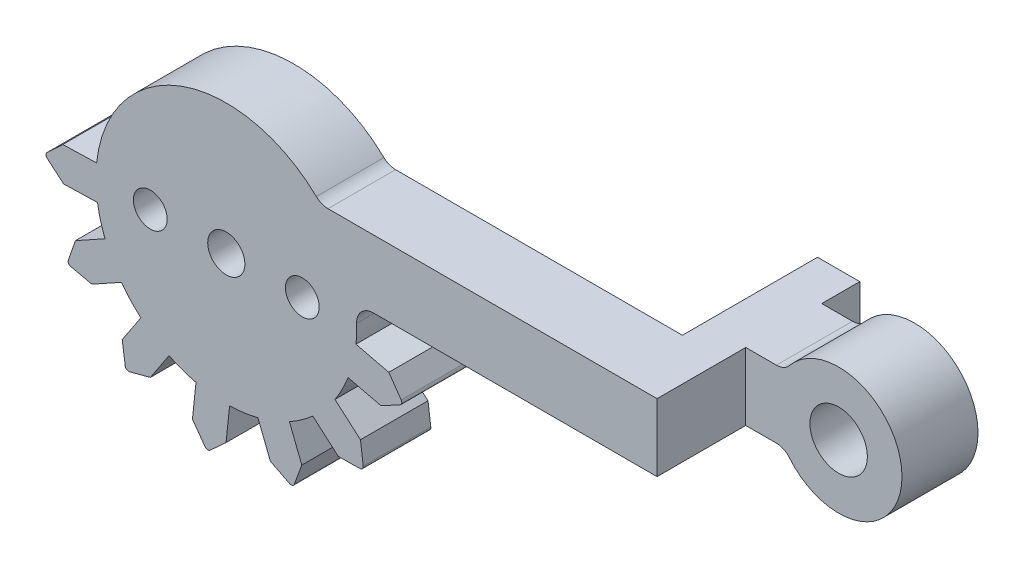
ISO-10303-21;
HEADER;
FILE_DESCRIPTION(('STEP AP214'),'2;1');
FILE_NAME('part.step','',(''),(''),'','','');
FILE_SCHEMA(('AUTOMOTIVE_DESIGN { 1 0 10303 214 1 1 1 1 }'));
ENDSEC;
DATA;
#1=APPLICATION_CONTEXT('core data for automotive mechanical design processes');
#2=APPLICATION_PROTOCOL_DEFINITION('international standard','automotive_design',2000,#1);
#3=PRODUCT_CONTEXT('',#1,'mechanical');
#4=PRODUCT('Part','Part','',(#3));
#5=PRODUCT_RELATED_PRODUCT_CATEGORY('part','',(#4));
#6=PRODUCT_DEFINITION_FORMATION('','',#4);
#7=PRODUCT_DEFINITION_CONTEXT('part definition',#1,'design');
#8=PRODUCT_DEFINITION('design','',#6,#7);
#9=PRODUCT_DEFINITION_SHAPE('','',#8);
#10=(LENGTH_UNIT() NAMED_UNIT(*) SI_UNIT(.MILLI.,.METRE.));
#11=(NAMED_UNIT(*) PLANE_ANGLE_UNIT() SI_UNIT($,.RADIAN.));
#12=(NAMED_UNIT(*) SI_UNIT($,.STERADIAN.) SOLID_ANGLE_UNIT());
#13=UNCERTAINTY_MEASURE_WITH_UNIT(LENGTH_MEASURE(1.E-05),#10,'distance_accuracy_value','');
#14=(GEOMETRIC_REPRESENTATION_CONTEXT(3) GLOBAL_UNCERTAINTY_ASSIGNED_CONTEXT((#13)) GLOBAL_UNIT_ASSIGNED_CONTEXT((#10,
#11,#12)) REPRESENTATION_CONTEXT('',''));
#15=CARTESIAN_POINT('',(0.,0.,0.));
#16=DIRECTION('',(0.,0.,1.));
#17=DIRECTION('',(1.,0.,0.));
#18=AXIS2_PLACEMENT_3D('',#15,#16,#17);
#19=CARTESIAN_POINT('',(67.1183581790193,0.,-4.));
#20=DIRECTION('',(-1.,0.,0.));
#21=DIRECTION('',(0.,0.,1.));
#22=AXIS2_PLACEMENT_3D('',#19,#20,#21);
#23=PLANE('',#22);
#24=DIRECTION('',(0.,-1.,0.));
#25=VECTOR('',#24,1.);
#26=CARTESIAN_POINT('',(67.1183581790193,25.5621778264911,-5.25));
#27=LINE('',#26,#25);
#28=CARTESIAN_POINT('',(67.1183581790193,25.5621778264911,-5.25));
#29=VERTEX_POINT('',#28);
#30=CARTESIAN_POINT('',(67.1183581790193,21.5621778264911,-5.25));
#31=VERTEX_POINT('',#30);
#32=EDGE_CURVE('E52',#29,#31,#27,.T.);
#33=ORIENTED_EDGE('',*,*,#32,.F.);
#34=DIRECTION('',(0.,0.,1.));
#35=VECTOR('',#34,1.);
#36=CARTESIAN_POINT('',(67.1183581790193,25.5621778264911,-4.));
#37=LINE('',#36,#35);
#38=CARTESIAN_POINT('',(67.1183581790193,25.5621778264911,0.));
#39=VERTEX_POINT('',#38);
#40=EDGE_CURVE('E44',#29,#39,#37,.T.);
#41=ORIENTED_EDGE('',*,*,#40,.T.);
#42=DIRECTION('',(0.,-1.,0.));
#43=VECTOR('',#42,1.);
#44=CARTESIAN_POINT('',(67.1183581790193,0.,0.));
#45=LINE('',#44,#43);
#46=CARTESIAN_POINT('',(67.1183581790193,21.5621778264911,0.));
#47=VERTEX_POINT('',#46);
#48=EDGE_CURVE('E437',#39,#47,#45,.T.);
#49=ORIENTED_EDGE('',*,*,#48,.T.);
#50=DIRECTION('',(0.,0.,1.));
#51=VECTOR('',#50,1.);
#52=CARTESIAN_POINT('',(67.1183581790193,21.5621778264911,-4.));
#53=LINE('',#52,#51);
#54=EDGE_CURVE('E434',#31,#47,#53,.T.);
#55=ORIENTED_EDGE('',*,*,#54,.F.);
#56=EDGE_LOOP('',(#33,#41,#49,#55));
#57=FACE_BOUND('',#56,.T.);
#58=ADVANCED_FACE('F35',(#57),#23,.F.);
#59=CARTESIAN_POINT('',(41.6183581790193,20.2558549,-4.));
#60=DIRECTION('',(0.,0.,1.));
#61=DIRECTION('',(1.,0.,0.));
#62=AXIS2_PLACEMENT_3D('',#59,#60,#61);
#63=CYLINDRICAL_SURFACE('',#62,7.71892819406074);
#64=CARTESIAN_POINT('',(41.6183581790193,20.2558549,0.));
#65=DIRECTION('',(0.,0.,1.));
#66=DIRECTION('',(1.,0.,0.));
#67=AXIS2_PLACEMENT_3D('',#64,#65,#66);
#68=CIRCLE('',#67,7.71892819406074);
#69=CARTESIAN_POINT('',(49.2942045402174,19.4414624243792,0.));
#70=VERTEX_POINT('',#69);
#71=CARTESIAN_POINT('',(49.3325210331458,20.5270447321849,0.));
#72=VERTEX_POINT('',#71);
#73=EDGE_CURVE('E914',#70,#72,#68,.T.);
#74=ORIENTED_EDGE('',*,*,#73,.F.);
#75=DIRECTION('',(0.,0.,1.));
#76=VECTOR('',#75,1.);
#77=CARTESIAN_POINT('',(49.2942045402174,19.4414624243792,-4.));
#78=LINE('',#77,#76);
#79=CARTESIAN_POINT('',(49.2942045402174,19.4414624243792,-4.));
#80=VERTEX_POINT('',#79);
#81=EDGE_CURVE('E627',#80,#70,#78,.T.);
#82=ORIENTED_EDGE('',*,*,#81,.F.);
#83=CARTESIAN_POINT('',(41.6183581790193,20.2558549,-4.));
#84=DIRECTION('',(0.,0.,1.));
#85=DIRECTION('',(1.,0.,0.));
#86=AXIS2_PLACEMENT_3D('',#83,#84,#85);
#87=CIRCLE('',#86,7.71892819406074);
#88=CARTESIAN_POINT('',(49.3325210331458,20.5270447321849,-4.));
#89=VERTEX_POINT('',#88);
#90=EDGE_CURVE('E898',#80,#89,#87,.T.);
#91=ORIENTED_EDGE('',*,*,#90,.T.);
#92=DIRECTION('',(0.,0.,1.));
#93=VECTOR('',#92,1.);
#94=CARTESIAN_POINT('',(49.3325210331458,20.5270447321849,-4.));
#95=LINE('',#94,#93);
#96=EDGE_CURVE('E927',#89,#72,#95,.T.);
#97=ORIENTED_EDGE('',*,*,#96,.T.);
#98=EDGE_LOOP('',(#74,#82,#91,#97));
#99=FACE_BOUND('',#98,.T.);
#100=ADVANCED_FACE('F952',(#99),#63,.T.);
#101=DIRECTION('',(0.,0.,1.));
#102=VECTOR('',#101,1.);
#103=CARTESIAN_POINT('',(48.8273138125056,17.4967225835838,-4.));
#104=LINE('',#103,#102);
#105=CARTESIAN_POINT('',(48.8273138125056,17.4967225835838,-4.));
#106=VERTEX_POINT('',#105);
#107=CARTESIAN_POINT('',(48.8273138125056,17.4967225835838,0.));
#108=VERTEX_POINT('',#107);
#109=EDGE_CURVE('E624',#106,#108,#104,.T.);
#110=ORIENTED_EDGE('',*,*,#109,.T.);
#111=CARTESIAN_POINT('',(48.0508724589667,15.9891685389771,0.));
#112=VERTEX_POINT('',#111);
#113=EDGE_CURVE('E1607',#112,#108,#68,.T.);
#114=ORIENTED_EDGE('',*,*,#113,.F.);
#115=DIRECTION('',(0.,0.,1.));
#116=VECTOR('',#115,1.);
#117=CARTESIAN_POINT('',(48.0508724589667,15.9891685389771,-4.));
#118=LINE('',#117,#116);
#119=CARTESIAN_POINT('',(48.0508724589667,15.9891685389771,-4.));
#120=VERTEX_POINT('',#119);
#121=EDGE_CURVE('E670',#120,#112,#118,.T.);
#122=ORIENTED_EDGE('',*,*,#121,.F.);
#123=EDGE_CURVE('E1609',#120,#106,#87,.T.);
#124=ORIENTED_EDGE('',*,*,#123,.T.);
#125=EDGE_LOOP('',(#110,#114,#122,#124));
#126=FACE_BOUND('',#125,.T.);
#127=ADVANCED_FACE('F960',(#126),#63,.T.);
#128=DIRECTION('',(0.,0.,1.));
#129=VECTOR('',#128,1.);
#130=CARTESIAN_POINT('',(46.7387544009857,14.4797493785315,-4.));
#131=LINE('',#130,#129);
#132=CARTESIAN_POINT('',(46.7387544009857,14.4797493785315,-4.));
#133=VERTEX_POINT('',#132);
#134=CARTESIAN_POINT('',(46.7387544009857,14.4797493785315,0.));
#135=VERTEX_POINT('',#134);
#136=EDGE_CURVE('E667',#133,#135,#131,.T.);
#137=ORIENTED_EDGE('',*,*,#136,.T.);
#138=CARTESIAN_POINT('',(45.3539315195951,13.5010533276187,0.));
#139=VERTEX_POINT('',#138);
#140=EDGE_CURVE('E1611',#139,#135,#68,.T.);
#141=ORIENTED_EDGE('',*,*,#140,.F.);
#142=DIRECTION('',(0.,0.,1.));
#143=VECTOR('',#142,1.);
#144=CARTESIAN_POINT('',(45.3539315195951,13.5010533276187,-4.));
#145=LINE('',#144,#143);
#146=CARTESIAN_POINT('',(45.3539315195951,13.5010533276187,-4.));
#147=VERTEX_POINT('',#146);
#148=EDGE_CURVE('E713',#147,#139,#145,.T.);
#149=ORIENTED_EDGE('',*,*,#148,.F.);
#150=EDGE_CURVE('E1675',#147,#133,#87,.T.);
#151=ORIENTED_EDGE('',*,*,#150,.T.);
#152=EDGE_LOOP('',(#137,#141,#149,#151));
#153=FACE_BOUND('',#152,.T.);
#154=ADVANCED_FACE('F1578',(#153),#63,.T.);
#155=DIRECTION('',(0.,0.,1.));
#156=VECTOR('',#155,1.);
#157=CARTESIAN_POINT('',(43.493096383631,12.7680508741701,-4.));
#158=LINE('',#157,#156);
#159=CARTESIAN_POINT('',(43.493096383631,12.7680508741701,-4.));
#160=VERTEX_POINT('',#159);
#161=CARTESIAN_POINT('',(43.493096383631,12.7680508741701,0.));
#162=VERTEX_POINT('',#161);
#163=EDGE_CURVE('E710',#160,#162,#158,.T.);
#164=ORIENTED_EDGE('',*,*,#163,.T.);
#165=CARTESIAN_POINT('',(41.8128319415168,12.5393769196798,0.));
#166=VERTEX_POINT('',#165);
#167=EDGE_CURVE('E1613',#166,#162,#68,.T.);
#168=ORIENTED_EDGE('',*,*,#167,.F.);
#169=DIRECTION('',(0.,0.,1.));
#170=VECTOR('',#169,1.);
#171=CARTESIAN_POINT('',(41.8128319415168,12.5393769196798,-4.));
#172=LINE('',#171,#170);
#173=CARTESIAN_POINT('',(41.8128319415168,12.5393769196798,-4.));
#174=VERTEX_POINT('',#173);
#175=EDGE_CURVE('E756',#174,#166,#172,.T.);
#176=ORIENTED_EDGE('',*,*,#175,.F.);
#177=EDGE_CURVE('E1663',#174,#160,#87,.T.);
#178=ORIENTED_EDGE('',*,*,#177,.T.);
#179=EDGE_LOOP('',(#164,#168,#176,#178));
#180=FACE_BOUND('',#179,.T.);
#181=ADVANCED_FACE('F1570',(#180),#63,.T.);
#182=DIRECTION('',(0.,0.,1.));
#183=VECTOR('',#182,1.);
#184=CARTESIAN_POINT('',(39.8237881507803,12.7484338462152,-4.));
#185=LINE('',#184,#183);
#186=CARTESIAN_POINT('',(39.8237881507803,12.7484338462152,-4.));
#187=VERTEX_POINT('',#186);
#188=CARTESIAN_POINT('',(39.8237881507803,12.7484338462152,0.));
#189=VERTEX_POINT('',#188);
#190=EDGE_CURVE('E753',#187,#189,#185,.T.);
#191=ORIENTED_EDGE('',*,*,#190,.T.);
#192=CARTESIAN_POINT('',(38.227785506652,13.321457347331,0.));
#193=VERTEX_POINT('',#192);
#194=EDGE_CURVE('E1616',#193,#189,#68,.T.);
#195=ORIENTED_EDGE('',*,*,#194,.F.);
#196=DIRECTION('',(0.,0.,1.));
#197=VECTOR('',#196,1.);
#198=CARTESIAN_POINT('',(38.227785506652,13.321457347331,-4.));
#199=LINE('',#198,#197);
#200=CARTESIAN_POINT('',(38.227785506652,13.321457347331,-4.));
#201=VERTEX_POINT('',#200);
#202=EDGE_CURVE('E799',#201,#193,#199,.T.);
#203=ORIENTED_EDGE('',*,*,#202,.F.);
#204=EDGE_CURVE('E1651',#201,#187,#87,.T.);
#205=ORIENTED_EDGE('',*,*,#204,.T.);
#206=EDGE_LOOP('',(#191,#195,#203,#205));
#207=FACE_BOUND('',#206,.T.);
#208=ADVANCED_FACE('F977',(#207),#63,.T.);
#209=DIRECTION('',(0.,0.,1.));
#210=VECTOR('',#209,1.);
#211=CARTESIAN_POINT('',(36.5600138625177,14.4253313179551,-4.));
#212=LINE('',#211,#210);
#213=CARTESIAN_POINT('',(36.5600138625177,14.4253313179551,-4.));
#214=VERTEX_POINT('',#213);
#215=CARTESIAN_POINT('',(36.5600138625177,14.4253313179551,0.));
#216=VERTEX_POINT('',#215);
#217=EDGE_CURVE('E796',#214,#216,#212,.T.);
#218=ORIENTED_EDGE('',*,*,#217,.T.);
#219=CARTESIAN_POINT('',(35.4089350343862,15.6705613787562,0.));
#220=VERTEX_POINT('',#219);
#221=EDGE_CURVE('E1619',#220,#216,#68,.T.);
#222=ORIENTED_EDGE('',*,*,#221,.F.);
#223=DIRECTION('',(0.,0.,1.));
#224=VECTOR('',#223,1.);
#225=CARTESIAN_POINT('',(35.4089350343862,15.6705613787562,-4.));
#226=LINE('',#225,#224);
#227=CARTESIAN_POINT('',(35.4089350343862,15.6705613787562,-4.));
#228=VERTEX_POINT('',#227);
#229=EDGE_CURVE('E842',#228,#220,#226,.T.);
#230=ORIENTED_EDGE('',*,*,#229,.F.);
#231=EDGE_CURVE('E1639',#228,#214,#87,.T.);
#232=ORIENTED_EDGE('',*,*,#231,.T.);
#233=EDGE_LOOP('',(#218,#222,#230,#232));
#234=FACE_BOUND('',#233,.T.);
#235=ADVANCED_FACE('F972',(#234),#63,.T.);
#236=DIRECTION('',(0.,0.,1.));
#237=VECTOR('',#236,1.);
#238=CARTESIAN_POINT('',(34.4393157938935,17.4198007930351,-4.));
#239=LINE('',#238,#237);
#240=CARTESIAN_POINT('',(34.4393157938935,17.4198007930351,-4.));
#241=VERTEX_POINT('',#240);
#242=CARTESIAN_POINT('',(34.4393157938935,17.4198007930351,0.));
#243=VERTEX_POINT('',#242);
#244=EDGE_CURVE('E839',#241,#243,#239,.T.);
#245=ORIENTED_EDGE('',*,*,#244,.T.);
#246=CARTESIAN_POINT('',(33.9932796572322,19.0558423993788,0.));
#247=VERTEX_POINT('',#246);
#248=EDGE_CURVE('E919',#247,#243,#68,.T.);
#249=ORIENTED_EDGE('',*,*,#248,.F.);
#250=DIRECTION('',(0.,0.,1.));
#251=VECTOR('',#250,1.);
#252=CARTESIAN_POINT('',(33.9932796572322,19.0558423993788,-4.));
#253=LINE('',#252,#251);
#254=CARTESIAN_POINT('',(33.9932796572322,19.0558423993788,-4.));
#255=VERTEX_POINT('',#254);
#256=EDGE_CURVE('E885',#255,#247,#253,.T.);
#257=ORIENTED_EDGE('',*,*,#256,.F.);
#258=EDGE_CURVE('E903',#255,#241,#87,.T.);
#259=ORIENTED_EDGE('',*,*,#258,.T.);
#260=EDGE_LOOP('',(#245,#249,#257,#259));
#261=FACE_BOUND('',#260,.T.);
#262=ADVANCED_FACE('F953',(#261),#63,.T.);
#263=CARTESIAN_POINT('',(0.,25.5621778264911,-4.));
#264=DIRECTION('',(0.,-1.,0.));
#265=DIRECTION('',(0.,0.,-1.));
#266=AXIS2_PLACEMENT_3D('',#263,#264,#265);
#267=PLANE('',#266);
#268=DIRECTION('',(1.,0.,0.));
#269=VECTOR('',#268,1.);
#270=CARTESIAN_POINT('',(0.,25.5621778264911,0.));
#271=LINE('',#270,#269);
#272=CARTESIAN_POINT('',(47.6391554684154,25.5621778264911,0.));
#273=VERTEX_POINT('',#272);
#274=EDGE_CURVE('E881',#273,#39,#271,.T.);
#275=ORIENTED_EDGE('',*,*,#274,.T.);
#276=ORIENTED_EDGE('',*,*,#40,.F.);
#277=DIRECTION('',(-1.,0.,0.));
#278=VECTOR('',#277,1.);
#279=CARTESIAN_POINT('',(67.1183581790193,25.5621778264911,-5.25));
#280=LINE('',#279,#278);
#281=CARTESIAN_POINT('',(68.9356282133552,25.5621778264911,-5.25));
#282=VERTEX_POINT('',#281);
#283=EDGE_CURVE('E456',#282,#29,#280,.T.);
#284=ORIENTED_EDGE('',*,*,#283,.F.);
#285=DIRECTION('',(0.,0.,-1.));
#286=VECTOR('',#285,1.);
#287=CARTESIAN_POINT('',(68.9356282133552,25.5621778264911,-5.25));
#288=LINE('',#287,#286);
#289=CARTESIAN_POINT('',(68.9356282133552,25.5621778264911,-9.75));
#290=VERTEX_POINT('',#289);
#291=EDGE_CURVE('E471',#282,#290,#288,.T.);
#292=ORIENTED_EDGE('',*,*,#291,.T.);
#293=DIRECTION('',(-1.,0.,0.));
#294=VECTOR('',#293,1.);
#295=CARTESIAN_POINT('',(67.1183581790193,25.5621778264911,-9.75));
#296=LINE('',#295,#294);
#297=CARTESIAN_POINT('',(67.1183581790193,25.5621778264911,-9.75));
#298=VERTEX_POINT('',#297);
#299=EDGE_CURVE('E457',#290,#298,#296,.T.);
#300=ORIENTED_EDGE('',*,*,#299,.T.);
#301=CARTESIAN_POINT('',(67.1183581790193,25.5621778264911,-12.));
#302=VERTEX_POINT('',#301);
#303=EDGE_CURVE('E11',#302,#298,#37,.T.);
#304=ORIENTED_EDGE('',*,*,#303,.F.);
#305=DIRECTION('',(1.,0.,0.));
#306=VECTOR('',#305,1.);
#307=CARTESIAN_POINT('',(0.,25.5621778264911,-12.));
#308=LINE('',#307,#306);
#309=CARTESIAN_POINT('',(64.6183581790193,25.5621778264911,-12.));
#310=VERTEX_POINT('',#309);
#311=EDGE_CURVE('E500',#310,#302,#308,.T.);
#312=ORIENTED_EDGE('',*,*,#311,.F.);
#313=DIRECTION('',(0.,0.,1.));
#314=VECTOR('',#313,1.);
#315=CARTESIAN_POINT('',(64.6183581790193,25.5621778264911,-12.));
#316=LINE('',#315,#314);
#317=CARTESIAN_POINT('',(64.6183581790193,25.5621778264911,-4.));
#318=VERTEX_POINT('',#317);
#319=EDGE_CURVE('E503',#310,#318,#316,.T.);
#320=ORIENTED_EDGE('',*,*,#319,.T.);
#321=DIRECTION('',(1.,0.,0.));
#322=VECTOR('',#321,1.);
#323=CARTESIAN_POINT('',(0.,25.5621778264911,-4.));
#324=LINE('',#323,#322);
#325=CARTESIAN_POINT('',(47.6391554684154,25.5621778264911,-4.));
#326=VERTEX_POINT('',#325);
#327=EDGE_CURVE('E893',#326,#318,#324,.T.);
#328=ORIENTED_EDGE('',*,*,#327,.F.);
#329=DIRECTION('',(0.,0.,1.));
#330=VECTOR('',#329,1.);
#331=CARTESIAN_POINT('',(47.6391554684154,25.5621778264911,-4.));
#332=LINE('',#331,#330);
#333=EDGE_CURVE('E39',#326,#273,#332,.T.);
#334=ORIENTED_EDGE('',*,*,#333,.T.);
#335=EDGE_LOOP('',(#275,#276,#284,#292,#300,#304,#312,#320,#328,#334));
#336=FACE_BOUND('',#335,.T.);
#337=ADVANCED_FACE('F37',(#336),#267,.F.);
#338=ORIENTED_EDGE('',*,*,#303,.T.);
#339=DIRECTION('',(0.,-1.,0.));
#340=VECTOR('',#339,1.);
#341=CARTESIAN_POINT('',(67.1183581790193,25.5621778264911,-9.75));
#342=LINE('',#341,#340);
#343=CARTESIAN_POINT('',(67.1183581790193,21.5621778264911,-9.75));
#344=VERTEX_POINT('',#343);
#345=EDGE_CURVE('E472',#298,#344,#342,.T.);
#346=ORIENTED_EDGE('',*,*,#345,.T.);
#347=CARTESIAN_POINT('',(67.1183581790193,21.5621778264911,-12.));
#348=VERTEX_POINT('',#347);
#349=EDGE_CURVE('E441',#348,#344,#53,.T.);
#350=ORIENTED_EDGE('',*,*,#349,.F.);
#351=DIRECTION('',(0.,-1.,0.));
#352=VECTOR('',#351,1.);
#353=CARTESIAN_POINT('',(67.1183581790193,0.,-12.));
#354=LINE('',#353,#352);
#355=EDGE_CURVE('E491',#302,#348,#354,.T.);
#356=ORIENTED_EDGE('',*,*,#355,.F.);
#357=EDGE_LOOP('',(#338,#346,#350,#356));
#358=FACE_BOUND('',#357,.T.);
#359=ADVANCED_FACE('F956',(#358),#23,.F.);
#360=CARTESIAN_POINT('',(0.,21.5621778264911,-4.));
#361=DIRECTION('',(0.,-1.,0.));
#362=DIRECTION('',(1.,0.,0.));
#363=AXIS2_PLACEMENT_3D('',#360,#361,#362);
#364=PLANE('',#363);
#365=DIRECTION('',(1.,0.,0.));
#366=VECTOR('',#365,1.);
#367=CARTESIAN_POINT('',(0.,21.5621778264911,0.));
#368=LINE('',#367,#366);
#369=CARTESIAN_POINT('',(50.3319036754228,21.5621778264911,0.));
#370=VERTEX_POINT('',#369);
#371=EDGE_CURVE('E922',#370,#47,#368,.T.);
#372=ORIENTED_EDGE('',*,*,#371,.F.);
#373=DIRECTION('',(0.,0.,1.));
#374=VECTOR('',#373,1.);
#375=CARTESIAN_POINT('',(50.3319036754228,21.5621778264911,-4.));
#376=LINE('',#375,#374);
#377=CARTESIAN_POINT('',(50.3319036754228,21.5621778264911,-4.));
#378=VERTEX_POINT('',#377);
#379=EDGE_CURVE('E442',#378,#370,#376,.T.);
#380=ORIENTED_EDGE('',*,*,#379,.F.);
#381=DIRECTION('',(1.,0.,0.));
#382=VECTOR('',#381,1.);
#383=CARTESIAN_POINT('',(0.,21.5621778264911,-4.));
#384=LINE('',#383,#382);
#385=CARTESIAN_POINT('',(64.6183581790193,21.5621778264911,-4.));
#386=VERTEX_POINT('',#385);
#387=EDGE_CURVE('E906',#378,#386,#384,.T.);
#388=ORIENTED_EDGE('',*,*,#387,.T.);
#389=DIRECTION('',(0.,0.,1.));
#390=VECTOR('',#389,1.);
#391=CARTESIAN_POINT('',(64.6183581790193,21.5621778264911,-12.));
#392=LINE('',#391,#390);
#393=CARTESIAN_POINT('',(64.6183581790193,21.5621778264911,-12.));
#394=VERTEX_POINT('',#393);
#395=EDGE_CURVE('E507',#394,#386,#392,.T.);
#396=ORIENTED_EDGE('',*,*,#395,.F.);
#397=DIRECTION('',(1.,0.,0.));
#398=VECTOR('',#397,1.);
#399=CARTESIAN_POINT('',(0.,21.5621778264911,-12.));
#400=LINE('',#399,#398);
#401=EDGE_CURVE('E494',#394,#348,#400,.T.);
#402=ORIENTED_EDGE('',*,*,#401,.T.);
#403=ORIENTED_EDGE('',*,*,#349,.T.);
#404=DIRECTION('',(1.,0.,0.));
#405=VECTOR('',#404,1.);
#406=CARTESIAN_POINT('',(67.1183581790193,21.5621778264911,-9.75));
#407=LINE('',#406,#405);
#408=CARTESIAN_POINT('',(68.9356282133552,21.5621778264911,-9.75));
#409=VERTEX_POINT('',#408);
#410=EDGE_CURVE('E474',#344,#409,#407,.T.);
#411=ORIENTED_EDGE('',*,*,#410,.T.);
#412=DIRECTION('',(0.,0.,-1.));
#413=VECTOR('',#412,1.);
#414=CARTESIAN_POINT('',(68.9356282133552,21.5621778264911,-5.25));
#415=LINE('',#414,#413);
#416=CARTESIAN_POINT('',(68.9356282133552,21.5621778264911,-5.25));
#417=VERTEX_POINT('',#416);
#418=EDGE_CURVE('E448',#417,#409,#415,.T.);
#419=ORIENTED_EDGE('',*,*,#418,.F.);
#420=DIRECTION('',(1.,0.,0.));
#421=VECTOR('',#420,1.);
#422=CARTESIAN_POINT('',(67.1183581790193,21.5621778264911,-5.25));
#423=LINE('',#422,#421);
#424=EDGE_CURVE('E445',#31,#417,#423,.T.);
#425=ORIENTED_EDGE('',*,*,#424,.F.);
#426=ORIENTED_EDGE('',*,*,#54,.T.);
#427=EDGE_LOOP('',(#372,#380,#388,#396,#402,#403,#411,#419,#425,#426));
#428=FACE_BOUND('',#427,.T.);
#429=ADVANCED_FACE('F446',(#428),#364,.T.);
#430=CARTESIAN_POINT('',(50.3319036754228,20.5621778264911,-4.));
#431=DIRECTION('',(0.,0.,1.));
#432=DIRECTION('',(1.,0.,0.));
#433=AXIS2_PLACEMENT_3D('',#430,#431,#432);
#434=CYLINDRICAL_SURFACE('',#433,1.);
#435=CARTESIAN_POINT('',(50.3319036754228,20.5621778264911,0.));
#436=DIRECTION('',(0.,0.,1.));
#437=DIRECTION('',(1.,0.,0.));
#438=AXIS2_PLACEMENT_3D('',#435,#436,#437);
#439=CIRCLE('',#438,1.);
#440=EDGE_CURVE('E918',#370,#72,#439,.T.);
#441=ORIENTED_EDGE('',*,*,#440,.T.);
#442=ORIENTED_EDGE('',*,*,#96,.F.);
#443=CARTESIAN_POINT('',(50.3319036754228,20.5621778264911,-4.));
#444=DIRECTION('',(0.,0.,1.));
#445=DIRECTION('',(1.,0.,0.));
#446=AXIS2_PLACEMENT_3D('',#443,#444,#445);
#447=CIRCLE('',#446,1.);
#448=EDGE_CURVE('E902',#378,#89,#447,.T.);
#449=ORIENTED_EDGE('',*,*,#448,.F.);
#450=ORIENTED_EDGE('',*,*,#379,.T.);
#451=EDGE_LOOP('',(#441,#442,#449,#450));
#452=FACE_BOUND('',#451,.T.);
#453=ADVANCED_FACE('F949',(#452),#434,.F.);
#454=DIRECTION('',(0.,0.,1.));
#455=VECTOR('',#454,1.);
#456=CARTESIAN_POINT('',(33.9409257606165,21.0551570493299,-4.));
#457=LINE('',#456,#455);
#458=CARTESIAN_POINT('',(33.9409257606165,21.0551570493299,-4.));
#459=VERTEX_POINT('',#458);
#460=CARTESIAN_POINT('',(33.9409257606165,21.0551570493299,0.));
#461=VERTEX_POINT('',#460);
#462=EDGE_CURVE('E882',#459,#461,#457,.T.);
#463=ORIENTED_EDGE('',*,*,#462,.T.);
#464=CARTESIAN_POINT('',(46.9486121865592,25.8388867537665,0.));
#465=VERTEX_POINT('',#464);
#466=EDGE_CURVE('E915',#465,#461,#68,.T.);
#467=ORIENTED_EDGE('',*,*,#466,.F.);
#468=DIRECTION('',(0.,0.,1.));
#469=VECTOR('',#468,1.);
#470=CARTESIAN_POINT('',(46.9486121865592,25.8388867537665,-4.));
#471=LINE('',#470,#469);
#472=CARTESIAN_POINT('',(46.9486121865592,25.8388867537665,-4.));
#473=VERTEX_POINT('',#472);
#474=EDGE_CURVE('E929',#473,#465,#471,.T.);
#475=ORIENTED_EDGE('',*,*,#474,.F.);
#476=EDGE_CURVE('E899',#473,#459,#87,.T.);
#477=ORIENTED_EDGE('',*,*,#476,.T.);
#478=EDGE_LOOP('',(#463,#467,#475,#477));
#479=FACE_BOUND('',#478,.T.);
#480=ADVANCED_FACE('F942',(#479),#63,.T.);
#481=CARTESIAN_POINT('',(47.6391554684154,26.5621778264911,-4.));
#482=DIRECTION('',(0.,0.,1.));
#483=DIRECTION('',(1.,0.,0.));
#484=AXIS2_PLACEMENT_3D('',#481,#482,#483);
#485=CYLINDRICAL_SURFACE('',#484,0.999999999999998);
#486=CARTESIAN_POINT('',(47.6391554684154,26.5621778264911,0.));
#487=DIRECTION('',(0.,0.,1.));
#488=DIRECTION('',(1.,0.,0.));
#489=AXIS2_PLACEMENT_3D('',#486,#487,#488);
#490=CIRCLE('',#489,0.999999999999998);
#491=EDGE_CURVE('E911',#273,#465,#490,.F.);
#492=ORIENTED_EDGE('',*,*,#491,.F.);
#493=ORIENTED_EDGE('',*,*,#333,.F.);
#494=CARTESIAN_POINT('',(47.6391554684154,26.5621778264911,-4.));
#495=DIRECTION('',(0.,0.,1.));
#496=DIRECTION('',(1.,0.,0.));
#497=AXIS2_PLACEMENT_3D('',#494,#495,#496);
#498=CIRCLE('',#497,0.999999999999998);
#499=EDGE_CURVE('E895',#326,#473,#498,.F.);
#500=ORIENTED_EDGE('',*,*,#499,.T.);
#501=ORIENTED_EDGE('',*,*,#474,.T.);
#502=EDGE_LOOP('',(#492,#493,#500,#501));
#503=FACE_BOUND('',#502,.T.);
#504=ADVANCED_FACE('F939',(#503),#485,.F.);
#505=CARTESIAN_POINT('',(0.,0.,-4.));
#506=DIRECTION('',(0.,0.,1.));
#507=DIRECTION('',(1.,0.,0.));
#508=AXIS2_PLACEMENT_3D('',#505,#506,#507);
#509=PLANE('',#508);
#510=CARTESIAN_POINT('',(41.6183581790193,20.2558549,-4.));
#511=DIRECTION('',(0.,0.,-1.));
#512=DIRECTION('',(-1.,0.,0.));
#513=AXIS2_PLACEMENT_3D('',#510,#511,#512);
#514=CIRCLE('',#513,4.5);
#515=CARTESIAN_POINT('',(44.972460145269,17.2558549,-4.));
#516=VERTEX_POINT('',#515);
#517=CARTESIAN_POINT('',(38.2642562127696,17.2558549,-4.));
#518=VERTEX_POINT('',#517);
#519=EDGE_CURVE('E554',#516,#518,#514,.T.);
#520=ORIENTED_EDGE('',*,*,#519,.F.);
#521=DIRECTION('',(-1.,0.,0.));
#522=VECTOR('',#521,1.);
#523=CARTESIAN_POINT('',(0.,17.2558549,-4.));
#524=LINE('',#523,#522);
#525=CARTESIAN_POINT('',(48.1183581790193,17.2558549,-4.));
#526=VERTEX_POINT('',#525);
#527=EDGE_CURVE('E528',#526,#516,#524,.T.);
#528=ORIENTED_EDGE('',*,*,#527,.F.);
#529=DIRECTION('',(0.,1.,0.));
#530=VECTOR('',#529,1.);
#531=CARTESIAN_POINT('',(48.1183581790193,0.,-4.));
#532=LINE('',#531,#530);
#533=CARTESIAN_POINT('',(48.1183581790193,23.2558549,-4.));
#534=VERTEX_POINT('',#533);
#535=EDGE_CURVE('E533',#526,#534,#532,.T.);
#536=ORIENTED_EDGE('',*,*,#535,.T.);
#537=DIRECTION('',(-1.,0.,0.));
#538=VECTOR('',#537,1.);
#539=CARTESIAN_POINT('',(0.,23.2558549,-4.));
#540=LINE('',#539,#538);
#541=CARTESIAN_POINT('',(44.972460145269,23.2558549,-4.));
#542=VERTEX_POINT('',#541);
#543=EDGE_CURVE('E569',#534,#542,#540,.T.);
#544=ORIENTED_EDGE('',*,*,#543,.T.);
#545=CARTESIAN_POINT('',(41.6183581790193,20.2558549,-4.));
#546=DIRECTION('',(0.,0.,-1.));
#547=DIRECTION('',(-1.,0.,0.));
#548=AXIS2_PLACEMENT_3D('',#545,#546,#547);
#549=CIRCLE('',#548,4.5);
#550=CARTESIAN_POINT('',(38.2642562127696,23.2558549,-4.));
#551=VERTEX_POINT('',#550);
#552=EDGE_CURVE('E566',#551,#542,#549,.T.);
#553=ORIENTED_EDGE('',*,*,#552,.F.);
#554=DIRECTION('',(-1.,0.,0.));
#555=VECTOR('',#554,1.);
#556=CARTESIAN_POINT('',(0.,23.2558549,-4.));
#557=LINE('',#556,#555);
#558=CARTESIAN_POINT('',(35.1183581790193,23.2558549,-4.));
#559=VERTEX_POINT('',#558);
#560=EDGE_CURVE('E563',#551,#559,#557,.T.);
#561=ORIENTED_EDGE('',*,*,#560,.T.);
#562=DIRECTION('',(0.,1.,0.));
#563=VECTOR('',#562,1.);
#564=CARTESIAN_POINT('',(35.1183581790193,0.,-4.));
#565=LINE('',#564,#563);
#566=CARTESIAN_POINT('',(35.1183581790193,17.2558549,-4.));
#567=VERTEX_POINT('',#566);
#568=EDGE_CURVE('E560',#567,#559,#565,.T.);
#569=ORIENTED_EDGE('',*,*,#568,.F.);
#570=DIRECTION('',(-1.,0.,0.));
#571=VECTOR('',#570,1.);
#572=CARTESIAN_POINT('',(0.,17.2558549,-4.));
#573=LINE('',#572,#571);
#574=EDGE_CURVE('E557',#518,#567,#573,.T.);
#575=ORIENTED_EDGE('',*,*,#574,.F.);
#576=EDGE_LOOP('',(#520,#528,#536,#544,#553,#561,#569,#575));
#577=FACE_BOUND('',#576,.T.);
#578=ORIENTED_EDGE('',*,*,#327,.T.);
#579=DIRECTION('',(0.,-1.,0.));
#580=VECTOR('',#579,1.);
#581=CARTESIAN_POINT('',(64.6183581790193,0.,-4.));
#582=LINE('',#581,#580);
#583=EDGE_CURVE('E490',#318,#386,#582,.T.);
#584=ORIENTED_EDGE('',*,*,#583,.T.);
#585=ORIENTED_EDGE('',*,*,#387,.F.);
#586=ORIENTED_EDGE('',*,*,#448,.T.);
#587=ORIENTED_EDGE('',*,*,#90,.F.);
#588=DIRECTION('',(0.972369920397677,-0.233445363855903,0.));
#589=VECTOR('',#588,1.);
#590=CARTESIAN_POINT('',(7.09949296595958,29.5715164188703,-4.));
#591=LINE('',#590,#589);
#592=CARTESIAN_POINT('',(51.2389443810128,18.9745716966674,-4.));
#593=VERTEX_POINT('',#592);
#594=EDGE_CURVE('E602',#80,#593,#591,.T.);
#595=ORIENTED_EDGE('',*,*,#594,.T.);
#596=DIRECTION('',(-0.571336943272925,0.82071560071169,0.));
#597=VECTOR('',#596,1.);
#598=CARTESIAN_POINT('',(43.410499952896,30.2199962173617,-4.));
#599=LINE('',#598,#597);
#600=CARTESIAN_POINT('',(51.9700858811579,17.9242996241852,-4.));
#601=VERTEX_POINT('',#600);
#602=EDGE_CURVE('E599',#601,#593,#599,.T.);
#603=ORIENTED_EDGE('',*,*,#602,.F.);
#604=CARTESIAN_POINT('',(51.8059427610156,17.8100322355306,-4.));
#605=DIRECTION('',(0.,0.,1.));
#606=DIRECTION('',(1.,0.,0.));
#607=AXIS2_PLACEMENT_3D('',#604,#605,#606);
#608=CIRCLE('',#607,0.199999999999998);
#609=CARTESIAN_POINT('',(51.9003190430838,17.6336998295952,-4.));
#610=VERTEX_POINT('',#609);
#611=EDGE_CURVE('E595',#610,#601,#608,.T.);
#612=ORIENTED_EDGE('',*,*,#611,.F.);
#613=DIRECTION('',(0.881662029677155,0.471881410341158,0.));
#614=VECTOR('',#613,1.);
#615=CARTESIAN_POINT('',(4.22042813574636,-7.88543721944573,-4.));
#616=LINE('',#615,#614);
#617=CARTESIAN_POINT('',(50.772053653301,17.029831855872,-4.));
#618=VERTEX_POINT('',#617);
#619=EDGE_CURVE('E592',#618,#610,#616,.T.);
#620=ORIENTED_EDGE('',*,*,#619,.F.);
#621=DIRECTION('',(0.972369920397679,-0.233445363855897,0.));
#622=VECTOR('',#621,1.);
#623=CARTESIAN_POINT('',(6.63260223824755,27.6267765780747,-4.));
#624=LINE('',#623,#622);
#625=EDGE_CURVE('E604',#106,#618,#624,.T.);
#626=ORIENTED_EDGE('',*,*,#625,.F.);
#627=ORIENTED_EDGE('',*,*,#123,.F.);
#628=DIRECTION('',(0.754709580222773,-0.656059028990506,0.));
#629=VECTOR('',#628,1.);
#630=CARTESIAN_POINT('',(28.598523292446,32.8988376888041,-4.));
#631=LINE('',#630,#629);
#632=CARTESIAN_POINT('',(49.5602916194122,14.6770504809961,-4.));
#633=VERTEX_POINT('',#632);
#634=EDGE_CURVE('E645',#120,#633,#631,.T.);
#635=ORIENTED_EDGE('',*,*,#634,.T.);
#636=DIRECTION('',(-0.127817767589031,0.991797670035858,0.));
#637=VECTOR('',#636,1.);
#638=CARTESIAN_POINT('',(50.6112065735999,6.52251122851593,-4.));
#639=LINE('',#638,#637);
#640=CARTESIAN_POINT('',(49.723860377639,13.4078442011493,-4.));
#641=VERTEX_POINT('',#640);
#642=EDGE_CURVE('E642',#641,#633,#639,.T.);
#643=ORIENTED_EDGE('',*,*,#642,.F.);
#644=CARTESIAN_POINT('',(49.5255008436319,13.3822806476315,-4.));
#645=DIRECTION('',(0.,0.,1.));
#646=DIRECTION('',(1.,0.,0.));
#647=AXIS2_PLACEMENT_3D('',#644,#645,#646);
#648=CIRCLE('',#647,0.199999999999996);
#649=CARTESIAN_POINT('',(49.5277923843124,13.1822937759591,-4.));
#650=VERTEX_POINT('',#649);
#651=EDGE_CURVE('E638',#650,#641,#648,.T.);
#652=ORIENTED_EDGE('',*,*,#651,.F.);
#653=DIRECTION('',(0.999934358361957,0.0114577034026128,0.));
#654=VECTOR('',#653,1.);
#655=CARTESIAN_POINT('',(-0.144526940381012,12.6131257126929,-4.));
#656=LINE('',#655,#654);
#657=CARTESIAN_POINT('',(48.2481735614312,13.1676313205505,-4.));
#658=VERTEX_POINT('',#657);
#659=EDGE_CURVE('E635',#658,#650,#656,.T.);
#660=ORIENTED_EDGE('',*,*,#659,.F.);
#661=DIRECTION('',(0.754709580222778,-0.656059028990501,0.));
#662=VECTOR('',#661,1.);
#663=CARTESIAN_POINT('',(27.2864052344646,31.3894185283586,-4.));
#664=LINE('',#663,#662);
#665=EDGE_CURVE('E647',#133,#658,#664,.T.);
#666=ORIENTED_EDGE('',*,*,#665,.F.);
#667=ORIENTED_EDGE('',*,*,#150,.F.);
#668=DIRECTION('',(0.366501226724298,-0.930417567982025,0.));
#669=VECTOR('',#668,1.);
#670=CARTESIAN_POINT('',(43.8656967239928,17.2791574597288,-4.));
#671=LINE('',#670,#669);
#672=CARTESIAN_POINT('',(46.0869339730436,11.6402181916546,-4.));
#673=VERTEX_POINT('',#672);
#674=EDGE_CURVE('E688',#147,#673,#671,.T.);
#675=ORIENTED_EDGE('',*,*,#674,.T.);
#676=DIRECTION('',(0.344585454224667,0.938754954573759,0.));
#677=VECTOR('',#676,1.);
#678=CARTESIAN_POINT('',(36.8492183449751,-13.526111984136,-4.));
#679=LINE('',#678,#677);
#680=CARTESIAN_POINT('',(45.6459669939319,10.4388908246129,-4.));
#681=VERTEX_POINT('',#680);
#682=EDGE_CURVE('E685',#681,#673,#679,.T.);
#683=ORIENTED_EDGE('',*,*,#682,.F.);
#684=CARTESIAN_POINT('',(45.4582160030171,10.5078079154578,-4.));
#685=DIRECTION('',(0.,0.,1.));
#686=DIRECTION('',(1.,0.,0.));
#687=AXIS2_PLACEMENT_3D('',#684,#685,#686);
#688=CIRCLE('',#687,0.199999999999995);
#689=CARTESIAN_POINT('',(45.3679049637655,10.3293592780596,-4.));
#690=VERTEX_POINT('',#689);
#691=EDGE_CURVE('E681',#690,#681,#688,.T.);
#692=ORIENTED_EDGE('',*,*,#691,.F.);
#693=DIRECTION('',(0.892243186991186,-0.451555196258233,0.));
#694=VECTOR('',#693,1.);
#695=CARTESIAN_POINT('',(13.4122792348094,26.501776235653,-4.));
#696=LINE('',#695,#694);
#697=CARTESIAN_POINT('',(44.2260988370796,10.907215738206,-4.));
#698=VERTEX_POINT('',#697);
#699=EDGE_CURVE('E678',#698,#690,#696,.T.);
#700=ORIENTED_EDGE('',*,*,#699,.F.);
#701=DIRECTION('',(0.366501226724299,-0.930417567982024,0.));
#702=VECTOR('',#701,1.);
#703=CARTESIAN_POINT('',(42.0048615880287,16.5461550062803,-4.));
#704=LINE('',#703,#702);
#705=EDGE_CURVE('E690',#160,#698,#704,.T.);
#706=ORIENTED_EDGE('',*,*,#705,.F.);
#707=ORIENTED_EDGE('',*,*,#177,.F.);
#708=DIRECTION('',(-0.104528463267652,-0.994521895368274,0.));
#709=VECTOR('',#708,1.);
#710=CARTESIAN_POINT('',(40.0524350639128,-4.20968055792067,-4.));
#711=LINE('',#710,#709);
#712=CARTESIAN_POINT('',(41.6037750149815,10.5503331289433,-4.));
#713=VERTEX_POINT('',#712);
#714=EDGE_CURVE('E731',#174,#713,#711,.T.);
#715=ORIENTED_EDGE('',*,*,#714,.T.);
#716=DIRECTION('',(0.739119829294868,0.673573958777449,0.));
#717=VECTOR('',#716,1.);
#718=CARTESIAN_POINT('',(13.6232077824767,-14.9488899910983,-4.));
#719=LINE('',#718,#717);
#720=CARTESIAN_POINT('',(40.6579212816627,9.6883586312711,-4.));
#721=VERTEX_POINT('',#720);
#722=EDGE_CURVE('E728',#721,#713,#719,.T.);
#723=ORIENTED_EDGE('',*,*,#722,.F.);
#724=CARTESIAN_POINT('',(40.5232064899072,9.83618259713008,-4.));
#725=DIRECTION('',(0.,0.,1.));
#726=DIRECTION('',(1.,0.,0.));
#727=AXIS2_PLACEMENT_3D('',#724,#725,#726);
#728=CIRCLE('',#727,0.199999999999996);
#729=CARTESIAN_POINT('',(40.3607012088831,9.71959771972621,-4.));
#730=VERTEX_POINT('',#729);
#731=EDGE_CURVE('E724',#730,#721,#728,.T.);
#732=ORIENTED_EDGE('',*,*,#731,.F.);
#733=DIRECTION('',(0.582924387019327,-0.812526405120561,0.));
#734=VECTOR('',#733,1.);
#735=CARTESIAN_POINT('',(31.2497054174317,22.419228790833,-4.));
#736=LINE('',#735,#734);
#737=CARTESIAN_POINT('',(39.614731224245,10.7593900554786,-4.));
#738=VERTEX_POINT('',#737);
#739=EDGE_CURVE('E721',#738,#730,#736,.T.);
#740=ORIENTED_EDGE('',*,*,#739,.F.);
#741=DIRECTION('',(-0.104528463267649,-0.994521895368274,0.));
#742=VECTOR('',#741,1.);
#743=CARTESIAN_POINT('',(38.0633912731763,-4.00062363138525,-4.));
#744=LINE('',#743,#742);
#745=EDGE_CURVE('E733',#187,#738,#744,.T.);
#746=ORIENTED_EDGE('',*,*,#745,.F.);
#747=ORIENTED_EDGE('',*,*,#204,.F.);
#748=DIRECTION('',(-0.551936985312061,-0.833885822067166,0.));
#749=VECTOR('',#748,1.);
#750=CARTESIAN_POINT('',(20.451052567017,-13.5362564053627,-4.));
#751=LINE('',#750,#749);
#752=CARTESIAN_POINT('',(37.1239115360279,11.6536857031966,-4.));
#753=VERTEX_POINT('',#752);
#754=EDGE_CURVE('E774',#201,#753,#751,.T.);
#755=ORIENTED_EDGE('',*,*,#754,.T.);
#756=DIRECTION('',(0.966629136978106,0.256179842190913,0.));
#757=VECTOR('',#756,1.);
#758=CARTESIAN_POINT('',(-0.449440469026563,1.69584870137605,-4.));
#759=LINE('',#758,#757);
#760=CARTESIAN_POINT('',(35.8869134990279,11.3258516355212,-4.));
#761=VERTEX_POINT('',#760);
#762=EDGE_CURVE('E771',#761,#753,#759,.T.);
#763=ORIENTED_EDGE('',*,*,#762,.F.);
#764=CARTESIAN_POINT('',(35.8356775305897,11.5191774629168,-4.));
#765=DIRECTION('',(0.,0.,1.));
#766=DIRECTION('',(1.,0.,0.));
#767=AXIS2_PLACEMENT_3D('',#764,#765,#766);
#768=CIRCLE('',#767,0.199999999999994);
#769=CARTESIAN_POINT('',(35.6377006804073,11.4908020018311,-4.));
#770=VERTEX_POINT('',#769);
#771=EDGE_CURVE('E767',#770,#761,#768,.T.);
#772=ORIENTED_EDGE('',*,*,#771,.F.);
#773=DIRECTION('',(0.141877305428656,-0.98988425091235,0.));
#774=VECTOR('',#773,1.);
#775=CARTESIAN_POINT('',(36.5341358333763,5.23633419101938,-4.));
#776=LINE('',#775,#774);
#777=CARTESIAN_POINT('',(35.4561398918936,12.7575596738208,-4.));
#778=VERTEX_POINT('',#777);
#779=EDGE_CURVE('E764',#778,#770,#776,.T.);
#780=ORIENTED_EDGE('',*,*,#779,.F.);
#781=DIRECTION('',(-0.551936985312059,-0.833885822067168,0.));
#782=VECTOR('',#781,1.);
#783=CARTESIAN_POINT('',(18.7832809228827,-12.4323824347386,-4.));
#784=LINE('',#783,#782);
#785=EDGE_CURVE('E776',#214,#778,#784,.T.);
#786=ORIENTED_EDGE('',*,*,#785,.F.);
#787=ORIENTED_EDGE('',*,*,#231,.F.);
#788=DIRECTION('',(-0.874619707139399,-0.484809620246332,0.));
#789=VECTOR('',#788,1.);
#790=CARTESIAN_POINT('',(1.67783424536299,-3.02689310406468,-4.));
#791=LINE('',#790,#789);
#792=CARTESIAN_POINT('',(33.6596956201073,14.7009421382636,-4.));
#793=VERTEX_POINT('',#792);
#794=EDGE_CURVE('E817',#228,#793,#791,.T.);
#795=ORIENTED_EDGE('',*,*,#794,.T.);
#796=DIRECTION('',(0.975701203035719,-0.219105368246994,0.));
#797=VECTOR('',#796,1.);
#798=CARTESIAN_POINT('',(4.75869404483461,21.19100751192,-4.));
#799=LINE('',#798,#797);
#800=CARTESIAN_POINT('',(32.4110880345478,14.9813318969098,-4.));
#801=VERTEX_POINT('',#800);
#802=EDGE_CURVE('E814',#801,#793,#799,.T.);
#803=ORIENTED_EDGE('',*,*,#802,.F.);
#804=CARTESIAN_POINT('',(32.4549091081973,15.1764721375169,-4.));
#805=DIRECTION('',(0.,0.,1.));
#806=DIRECTION('',(1.,0.,0.));
#807=AXIS2_PLACEMENT_3D('',#804,#805,#806);
#808=CIRCLE('',#807,0.199999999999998);
#809=CARTESIAN_POINT('',(32.2661991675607,15.2427183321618,-4.));
#810=VERTEX_POINT('',#809);
#811=EDGE_CURVE('E810',#810,#801,#808,.T.);
#812=ORIENTED_EDGE('',*,*,#811,.F.);
#813=DIRECTION('',(-0.331230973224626,-0.943549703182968,0.));
#814=VECTOR('',#813,1.);
#815=CARTESIAN_POINT('',(23.9622960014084,-8.41190940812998,-4.));
#816=LINE('',#815,#814);
#817=CARTESIAN_POINT('',(32.6900763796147,16.4501815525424,-4.));
#818=VERTEX_POINT('',#817);
#819=EDGE_CURVE('E807',#818,#810,#816,.T.);
#820=ORIENTED_EDGE('',*,*,#819,.F.);
#821=DIRECTION('',(-0.874619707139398,-0.484809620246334,0.));
#822=VECTOR('',#821,1.);
#823=CARTESIAN_POINT('',(0.708215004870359,-1.27765368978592,-4.));
#824=LINE('',#823,#822);
#825=EDGE_CURVE('E819',#241,#818,#824,.T.);
#826=ORIENTED_EDGE('',*,*,#825,.F.);
#827=ORIENTED_EDGE('',*,*,#258,.F.);
#828=DIRECTION('',(-0.999657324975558,-0.0261769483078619,0.));
#829=VECTOR('',#828,1.);
#830=CARTESIAN_POINT('',(-0.475359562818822,18.1532493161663,-4.));
#831=LINE('',#830,#829);
#832=CARTESIAN_POINT('',(31.9939650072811,19.003488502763,-4.));
#833=VERTEX_POINT('',#832);
#834=EDGE_CURVE('E860',#255,#833,#831,.T.);
#835=ORIENTED_EDGE('',*,*,#834,.T.);
#836=DIRECTION('',(0.764285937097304,-0.644877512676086,0.));
#837=VECTOR('',#836,1.);
#838=CARTESIAN_POINT('',(22.6714992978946,26.8694562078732,-4.));
#839=LINE('',#838,#837);
#840=CARTESIAN_POINT('',(31.0159061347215,19.8287400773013,-4.));
#841=VERTEX_POINT('',#840);
#842=EDGE_CURVE('E857',#841,#833,#839,.T.);
#843=ORIENTED_EDGE('',*,*,#842,.F.);
#844=CARTESIAN_POINT('',(31.1448816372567,19.9815972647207,-4.));
#845=DIRECTION('',(0.,0.,1.));
#846=DIRECTION('',(1.,0.,0.));
#847=AXIS2_PLACEMENT_3D('',#844,#845,#846);
#848=CIRCLE('',#847,0.199999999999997);
#849=CARTESIAN_POINT('',(31.008082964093,20.1274949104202,-4.));
#850=VERTEX_POINT('',#849);
#851=EDGE_CURVE('E853',#850,#841,#848,.T.);
#852=ORIENTED_EDGE('',*,*,#851,.F.);
#853=DIRECTION('',(-0.729488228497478,-0.68399336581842,0.));
#854=VECTOR('',#853,1.);
#855=CARTESIAN_POINT('',(4.46411856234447,-4.7610431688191,-4.));
#856=LINE('',#855,#854);
#857=CARTESIAN_POINT('',(31.9416111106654,21.0028031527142,-4.));
#858=VERTEX_POINT('',#857);
#859=EDGE_CURVE('E850',#858,#850,#856,.T.);
#860=ORIENTED_EDGE('',*,*,#859,.F.);
#861=DIRECTION('',(-0.999657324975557,-0.0261769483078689,0.));
#862=VECTOR('',#861,1.);
#863=CARTESIAN_POINT('',(-0.527713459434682,20.1525639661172,-4.));
#864=LINE('',#863,#862);
#865=EDGE_CURVE('E862',#459,#858,#864,.T.);
#866=ORIENTED_EDGE('',*,*,#865,.F.);
#867=ORIENTED_EDGE('',*,*,#476,.F.);
#868=ORIENTED_EDGE('',*,*,#499,.F.);
#869=EDGE_LOOP('',(#578,#584,#585,#586,#587,#595,#603,#612,#620,#626,#627,#635,#643,#652,#660,
#666,#667,#675,#683,#692,#700,#706,#707,#715,#723,#732,#740,#746,#747,#755,#763,#772,#780,#786,
#787,#795,#803,#812,#820,#826,#827,#835,#843,#852,#860,#866,#867,#868));
#870=FACE_BOUND('',#869,.T.);
#871=ADVANCED_FACE('F941',(#577,#870),#509,.F.);
#872=CARTESIAN_POINT('',(0.,0.,0.));
#873=DIRECTION('',(0.,0.,1.));
#874=DIRECTION('',(1.,0.,0.));
#875=AXIS2_PLACEMENT_3D('',#872,#873,#874);
#876=PLANE('',#875);
#877=CARTESIAN_POINT('',(46.1183581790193,20.2558549,0.));
#878=DIRECTION('',(0.,0.,-1.));
#879=DIRECTION('',(-1.,0.,0.));
#880=AXIS2_PLACEMENT_3D('',#877,#878,#879);
#881=CIRCLE('',#880,0.999999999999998);
#882=CARTESIAN_POINT('',(45.1183581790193,20.2558549,0.));
#883=VERTEX_POINT('',#882);
#884=EDGE_CURVE('E511',#883,#883,#881,.T.);
#885=ORIENTED_EDGE('',*,*,#884,.T.);
#886=EDGE_LOOP('',(#885));
#887=FACE_BOUND('',#886,.T.);
#888=CARTESIAN_POINT('',(41.6183581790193,20.2558549,0.));
#889=DIRECTION('',(0.,0.,-1.));
#890=DIRECTION('',(-1.,0.,0.));
#891=AXIS2_PLACEMENT_3D('',#888,#889,#890);
#892=CIRCLE('',#891,1.1);
#893=CARTESIAN_POINT('',(40.5183581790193,20.2558549,0.));
#894=VERTEX_POINT('',#893);
#895=EDGE_CURVE('E515',#894,#894,#892,.T.);
#896=ORIENTED_EDGE('',*,*,#895,.T.);
#897=EDGE_LOOP('',(#896));
#898=FACE_BOUND('',#897,.T.);
#899=CARTESIAN_POINT('',(37.1183581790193,20.2558549,0.));
#900=DIRECTION('',(0.,0.,-1.));
#901=DIRECTION('',(-1.,0.,0.));
#902=AXIS2_PLACEMENT_3D('',#899,#900,#901);
#903=CIRCLE('',#902,0.999999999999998);
#904=CARTESIAN_POINT('',(36.1183581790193,20.2558549,0.));
#905=VERTEX_POINT('',#904);
#906=EDGE_CURVE('E510',#905,#905,#903,.T.);
#907=ORIENTED_EDGE('',*,*,#906,.T.);
#908=EDGE_LOOP('',(#907));
#909=FACE_BOUND('',#908,.T.);
#910=ORIENTED_EDGE('',*,*,#274,.F.);
#911=ORIENTED_EDGE('',*,*,#491,.T.);
#912=ORIENTED_EDGE('',*,*,#466,.T.);
#913=DIRECTION('',(-0.999657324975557,-0.0261769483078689,0.));
#914=VECTOR('',#913,1.);
#915=CARTESIAN_POINT('',(-0.527713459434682,20.1525639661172,0.));
#916=LINE('',#915,#914);
#917=CARTESIAN_POINT('',(31.9416111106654,21.0028031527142,0.));
#918=VERTEX_POINT('',#917);
#919=EDGE_CURVE('E854',#461,#918,#916,.T.);
#920=ORIENTED_EDGE('',*,*,#919,.T.);
#921=DIRECTION('',(-0.729488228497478,-0.68399336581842,0.));
#922=VECTOR('',#921,1.);
#923=CARTESIAN_POINT('',(4.46411856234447,-4.7610431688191,0.));
#924=LINE('',#923,#922);
#925=CARTESIAN_POINT('',(31.008082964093,20.1274949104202,0.));
#926=VERTEX_POINT('',#925);
#927=EDGE_CURVE('E838',#918,#926,#924,.T.);
#928=ORIENTED_EDGE('',*,*,#927,.T.);
#929=CARTESIAN_POINT('',(31.1448816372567,19.9815972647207,0.));
#930=DIRECTION('',(0.,0.,1.));
#931=DIRECTION('',(1.,0.,0.));
#932=AXIS2_PLACEMENT_3D('',#929,#930,#931);
#933=CIRCLE('',#932,0.199999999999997);
#934=CARTESIAN_POINT('',(31.0159061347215,19.8287400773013,0.));
#935=VERTEX_POINT('',#934);
#936=EDGE_CURVE('E868',#926,#935,#933,.T.);
#937=ORIENTED_EDGE('',*,*,#936,.T.);
#938=DIRECTION('',(0.764285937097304,-0.644877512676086,0.));
#939=VECTOR('',#938,1.);
#940=CARTESIAN_POINT('',(22.6714992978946,26.8694562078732,0.));
#941=LINE('',#940,#939);
#942=CARTESIAN_POINT('',(31.9939650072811,19.003488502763,0.));
#943=VERTEX_POINT('',#942);
#944=EDGE_CURVE('E871',#935,#943,#941,.T.);
#945=ORIENTED_EDGE('',*,*,#944,.T.);
#946=DIRECTION('',(-0.999657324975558,-0.0261769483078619,0.));
#947=VECTOR('',#946,1.);
#948=CARTESIAN_POINT('',(-0.475359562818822,18.1532493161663,0.));
#949=LINE('',#948,#947);
#950=EDGE_CURVE('E874',#247,#943,#949,.T.);
#951=ORIENTED_EDGE('',*,*,#950,.F.);
#952=ORIENTED_EDGE('',*,*,#248,.T.);
#953=DIRECTION('',(-0.874619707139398,-0.484809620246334,0.));
#954=VECTOR('',#953,1.);
#955=CARTESIAN_POINT('',(0.708215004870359,-1.27765368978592,0.));
#956=LINE('',#955,#954);
#957=CARTESIAN_POINT('',(32.6900763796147,16.4501815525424,0.));
#958=VERTEX_POINT('',#957);
#959=EDGE_CURVE('E811',#243,#958,#956,.T.);
#960=ORIENTED_EDGE('',*,*,#959,.T.);
#961=DIRECTION('',(-0.331230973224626,-0.943549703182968,0.));
#962=VECTOR('',#961,1.);
#963=CARTESIAN_POINT('',(23.9622960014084,-8.41190940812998,0.));
#964=LINE('',#963,#962);
#965=CARTESIAN_POINT('',(32.2661991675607,15.2427183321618,0.));
#966=VERTEX_POINT('',#965);
#967=EDGE_CURVE('E795',#958,#966,#964,.T.);
#968=ORIENTED_EDGE('',*,*,#967,.T.);
#969=CARTESIAN_POINT('',(32.4549091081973,15.1764721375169,0.));
#970=DIRECTION('',(0.,0.,1.));
#971=DIRECTION('',(1.,0.,0.));
#972=AXIS2_PLACEMENT_3D('',#969,#970,#971);
#973=CIRCLE('',#972,0.199999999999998);
#974=CARTESIAN_POINT('',(32.4110880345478,14.9813318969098,0.));
#975=VERTEX_POINT('',#974);
#976=EDGE_CURVE('E825',#966,#975,#973,.T.);
#977=ORIENTED_EDGE('',*,*,#976,.T.);
#978=DIRECTION('',(0.975701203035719,-0.219105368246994,0.));
#979=VECTOR('',#978,1.);
#980=CARTESIAN_POINT('',(4.75869404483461,21.19100751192,0.));
#981=LINE('',#980,#979);
#982=CARTESIAN_POINT('',(33.6596956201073,14.7009421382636,0.));
#983=VERTEX_POINT('',#982);
#984=EDGE_CURVE('E828',#975,#983,#981,.T.);
#985=ORIENTED_EDGE('',*,*,#984,.T.);
#986=DIRECTION('',(-0.874619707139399,-0.484809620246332,0.));
#987=VECTOR('',#986,1.);
#988=CARTESIAN_POINT('',(1.67783424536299,-3.02689310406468,0.));
#989=LINE('',#988,#987);
#990=EDGE_CURVE('E831',#220,#983,#989,.T.);
#991=ORIENTED_EDGE('',*,*,#990,.F.);
#992=ORIENTED_EDGE('',*,*,#221,.T.);
#993=DIRECTION('',(-0.551936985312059,-0.833885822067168,0.));
#994=VECTOR('',#993,1.);
#995=CARTESIAN_POINT('',(18.7832809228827,-12.4323824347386,0.));
#996=LINE('',#995,#994);
#997=CARTESIAN_POINT('',(35.4561398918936,12.7575596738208,0.));
#998=VERTEX_POINT('',#997);
#999=EDGE_CURVE('E768',#216,#998,#996,.T.);
#1000=ORIENTED_EDGE('',*,*,#999,.T.);
#1001=DIRECTION('',(0.141877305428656,-0.98988425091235,0.));
#1002=VECTOR('',#1001,1.);
#1003=CARTESIAN_POINT('',(36.5341358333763,5.23633419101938,0.));
#1004=LINE('',#1003,#1002);
#1005=CARTESIAN_POINT('',(35.6377006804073,11.4908020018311,0.));
#1006=VERTEX_POINT('',#1005);
#1007=EDGE_CURVE('E752',#998,#1006,#1004,.T.);
#1008=ORIENTED_EDGE('',*,*,#1007,.T.);
#1009=CARTESIAN_POINT('',(35.8356775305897,11.5191774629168,0.));
#1010=DIRECTION('',(0.,0.,1.));
#1011=DIRECTION('',(1.,0.,0.));
#1012=AXIS2_PLACEMENT_3D('',#1009,#1010,#1011);
#1013=CIRCLE('',#1012,0.199999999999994);
#1014=CARTESIAN_POINT('',(35.8869134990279,11.3258516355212,0.));
#1015=VERTEX_POINT('',#1014);
#1016=EDGE_CURVE('E782',#1006,#1015,#1013,.T.);
#1017=ORIENTED_EDGE('',*,*,#1016,.T.);
#1018=DIRECTION('',(0.966629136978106,0.256179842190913,0.));
#1019=VECTOR('',#1018,1.);
#1020=CARTESIAN_POINT('',(-0.449440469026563,1.69584870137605,0.));
#1021=LINE('',#1020,#1019);
#1022=CARTESIAN_POINT('',(37.1239115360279,11.6536857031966,0.));
#1023=VERTEX_POINT('',#1022);
#1024=EDGE_CURVE('E785',#1015,#1023,#1021,.T.);
#1025=ORIENTED_EDGE('',*,*,#1024,.T.);
#1026=DIRECTION('',(-0.551936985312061,-0.833885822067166,0.));
#1027=VECTOR('',#1026,1.);
#1028=CARTESIAN_POINT('',(20.451052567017,-13.5362564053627,0.));
#1029=LINE('',#1028,#1027);
#1030=EDGE_CURVE('E788',#193,#1023,#1029,.T.);
#1031=ORIENTED_EDGE('',*,*,#1030,.F.);
#1032=ORIENTED_EDGE('',*,*,#194,.T.);
#1033=DIRECTION('',(-0.104528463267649,-0.994521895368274,0.));
#1034=VECTOR('',#1033,1.);
#1035=CARTESIAN_POINT('',(38.0633912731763,-4.00062363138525,0.));
#1036=LINE('',#1035,#1034);
#1037=CARTESIAN_POINT('',(39.614731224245,10.7593900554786,0.));
#1038=VERTEX_POINT('',#1037);
#1039=EDGE_CURVE('E725',#189,#1038,#1036,.T.);
#1040=ORIENTED_EDGE('',*,*,#1039,.T.);
#1041=DIRECTION('',(0.582924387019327,-0.812526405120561,0.));
#1042=VECTOR('',#1041,1.);
#1043=CARTESIAN_POINT('',(31.2497054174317,22.419228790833,0.));
#1044=LINE('',#1043,#1042);
#1045=CARTESIAN_POINT('',(40.3607012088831,9.71959771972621,0.));
#1046=VERTEX_POINT('',#1045);
#1047=EDGE_CURVE('E709',#1038,#1046,#1044,.T.);
#1048=ORIENTED_EDGE('',*,*,#1047,.T.);
#1049=CARTESIAN_POINT('',(40.5232064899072,9.83618259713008,0.));
#1050=DIRECTION('',(0.,0.,1.));
#1051=DIRECTION('',(1.,0.,0.));
#1052=AXIS2_PLACEMENT_3D('',#1049,#1050,#1051);
#1053=CIRCLE('',#1052,0.199999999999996);
#1054=CARTESIAN_POINT('',(40.6579212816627,9.6883586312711,0.));
#1055=VERTEX_POINT('',#1054);
#1056=EDGE_CURVE('E739',#1046,#1055,#1053,.T.);
#1057=ORIENTED_EDGE('',*,*,#1056,.T.);
#1058=DIRECTION('',(0.739119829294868,0.673573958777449,0.));
#1059=VECTOR('',#1058,1.);
#1060=CARTESIAN_POINT('',(13.6232077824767,-14.9488899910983,0.));
#1061=LINE('',#1060,#1059);
#1062=CARTESIAN_POINT('',(41.6037750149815,10.5503331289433,0.));
#1063=VERTEX_POINT('',#1062);
#1064=EDGE_CURVE('E742',#1055,#1063,#1061,.T.);
#1065=ORIENTED_EDGE('',*,*,#1064,.T.);
#1066=DIRECTION('',(-0.104528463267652,-0.994521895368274,0.));
#1067=VECTOR('',#1066,1.);
#1068=CARTESIAN_POINT('',(40.0524350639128,-4.20968055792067,0.));
#1069=LINE('',#1068,#1067);
#1070=EDGE_CURVE('E745',#166,#1063,#1069,.T.);
#1071=ORIENTED_EDGE('',*,*,#1070,.F.);
#1072=ORIENTED_EDGE('',*,*,#167,.T.);
#1073=DIRECTION('',(0.366501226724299,-0.930417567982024,0.));
#1074=VECTOR('',#1073,1.);
#1075=CARTESIAN_POINT('',(42.0048615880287,16.5461550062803,0.));
#1076=LINE('',#1075,#1074);
#1077=CARTESIAN_POINT('',(44.2260988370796,10.907215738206,0.));
#1078=VERTEX_POINT('',#1077);
#1079=EDGE_CURVE('E682',#162,#1078,#1076,.T.);
#1080=ORIENTED_EDGE('',*,*,#1079,.T.);
#1081=DIRECTION('',(0.892243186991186,-0.451555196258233,0.));
#1082=VECTOR('',#1081,1.);
#1083=CARTESIAN_POINT('',(13.4122792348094,26.501776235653,0.));
#1084=LINE('',#1083,#1082);
#1085=CARTESIAN_POINT('',(45.3679049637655,10.3293592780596,0.));
#1086=VERTEX_POINT('',#1085);
#1087=EDGE_CURVE('E666',#1078,#1086,#1084,.T.);
#1088=ORIENTED_EDGE('',*,*,#1087,.T.);
#1089=CARTESIAN_POINT('',(45.4582160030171,10.5078079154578,0.));
#1090=DIRECTION('',(0.,0.,1.));
#1091=DIRECTION('',(1.,0.,0.));
#1092=AXIS2_PLACEMENT_3D('',#1089,#1090,#1091);
#1093=CIRCLE('',#1092,0.199999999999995);
#1094=CARTESIAN_POINT('',(45.6459669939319,10.4388908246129,0.));
#1095=VERTEX_POINT('',#1094);
#1096=EDGE_CURVE('E696',#1086,#1095,#1093,.T.);
#1097=ORIENTED_EDGE('',*,*,#1096,.T.);
#1098=DIRECTION('',(0.344585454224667,0.938754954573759,0.));
#1099=VECTOR('',#1098,1.);
#1100=CARTESIAN_POINT('',(36.8492183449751,-13.526111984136,0.));
#1101=LINE('',#1100,#1099);
#1102=CARTESIAN_POINT('',(46.0869339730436,11.6402181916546,0.));
#1103=VERTEX_POINT('',#1102);
#1104=EDGE_CURVE('E699',#1095,#1103,#1101,.T.);
#1105=ORIENTED_EDGE('',*,*,#1104,.T.);
#1106=DIRECTION('',(0.366501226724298,-0.930417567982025,0.));
#1107=VECTOR('',#1106,1.);
#1108=CARTESIAN_POINT('',(43.8656967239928,17.2791574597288,0.));
#1109=LINE('',#1108,#1107);
#1110=EDGE_CURVE('E702',#139,#1103,#1109,.T.);
#1111=ORIENTED_EDGE('',*,*,#1110,.F.);
#1112=ORIENTED_EDGE('',*,*,#140,.T.);
#1113=DIRECTION('',(0.754709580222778,-0.656059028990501,0.));
#1114=VECTOR('',#1113,1.);
#1115=CARTESIAN_POINT('',(27.2864052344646,31.3894185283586,0.));
#1116=LINE('',#1115,#1114);
#1117=CARTESIAN_POINT('',(48.2481735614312,13.1676313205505,0.));
#1118=VERTEX_POINT('',#1117);
#1119=EDGE_CURVE('E639',#135,#1118,#1116,.T.);
#1120=ORIENTED_EDGE('',*,*,#1119,.T.);
#1121=DIRECTION('',(0.999934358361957,0.0114577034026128,0.));
#1122=VECTOR('',#1121,1.);
#1123=CARTESIAN_POINT('',(-0.144526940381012,12.6131257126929,0.));
#1124=LINE('',#1123,#1122);
#1125=CARTESIAN_POINT('',(49.5277923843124,13.1822937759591,0.));
#1126=VERTEX_POINT('',#1125);
#1127=EDGE_CURVE('E623',#1118,#1126,#1124,.T.);
#1128=ORIENTED_EDGE('',*,*,#1127,.T.);
#1129=CARTESIAN_POINT('',(49.5255008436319,13.3822806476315,0.));
#1130=DIRECTION('',(0.,0.,1.));
#1131=DIRECTION('',(1.,0.,0.));
#1132=AXIS2_PLACEMENT_3D('',#1129,#1130,#1131);
#1133=CIRCLE('',#1132,0.199999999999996);
#1134=CARTESIAN_POINT('',(49.723860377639,13.4078442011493,0.));
#1135=VERTEX_POINT('',#1134);
#1136=EDGE_CURVE('E653',#1126,#1135,#1133,.T.);
#1137=ORIENTED_EDGE('',*,*,#1136,.T.);
#1138=DIRECTION('',(-0.127817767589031,0.991797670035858,0.));
#1139=VECTOR('',#1138,1.);
#1140=CARTESIAN_POINT('',(50.6112065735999,6.52251122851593,0.));
#1141=LINE('',#1140,#1139);
#1142=CARTESIAN_POINT('',(49.5602916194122,14.6770504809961,0.));
#1143=VERTEX_POINT('',#1142);
#1144=EDGE_CURVE('E656',#1135,#1143,#1141,.T.);
#1145=ORIENTED_EDGE('',*,*,#1144,.T.);
#1146=DIRECTION('',(0.754709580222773,-0.656059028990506,0.));
#1147=VECTOR('',#1146,1.);
#1148=CARTESIAN_POINT('',(28.598523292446,32.8988376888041,0.));
#1149=LINE('',#1148,#1147);
#1150=EDGE_CURVE('E659',#112,#1143,#1149,.T.);
#1151=ORIENTED_EDGE('',*,*,#1150,.F.);
#1152=ORIENTED_EDGE('',*,*,#113,.T.);
#1153=DIRECTION('',(0.972369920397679,-0.233445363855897,0.));
#1154=VECTOR('',#1153,1.);
#1155=CARTESIAN_POINT('',(6.63260223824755,27.6267765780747,0.));
#1156=LINE('',#1155,#1154);
#1157=CARTESIAN_POINT('',(50.772053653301,17.029831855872,0.));
#1158=VERTEX_POINT('',#1157);
#1159=EDGE_CURVE('E596',#108,#1158,#1156,.T.);
#1160=ORIENTED_EDGE('',*,*,#1159,.T.);
#1161=DIRECTION('',(0.881662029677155,0.471881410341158,0.));
#1162=VECTOR('',#1161,1.);
#1163=CARTESIAN_POINT('',(4.22042813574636,-7.88543721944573,0.));
#1164=LINE('',#1163,#1162);
#1165=CARTESIAN_POINT('',(51.9003190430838,17.6336998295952,0.));
#1166=VERTEX_POINT('',#1165);
#1167=EDGE_CURVE('E576',#1158,#1166,#1164,.T.);
#1168=ORIENTED_EDGE('',*,*,#1167,.T.);
#1169=CARTESIAN_POINT('',(51.8059427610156,17.8100322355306,0.));
#1170=DIRECTION('',(0.,0.,1.));
#1171=DIRECTION('',(1.,0.,0.));
#1172=AXIS2_PLACEMENT_3D('',#1169,#1170,#1171);
#1173=CIRCLE('',#1172,0.199999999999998);
#1174=CARTESIAN_POINT('',(51.9700858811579,17.9242996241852,0.));
#1175=VERTEX_POINT('',#1174);
#1176=EDGE_CURVE('E610',#1166,#1175,#1173,.T.);
#1177=ORIENTED_EDGE('',*,*,#1176,.T.);
#1178=DIRECTION('',(-0.571336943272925,0.82071560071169,0.));
#1179=VECTOR('',#1178,1.);
#1180=CARTESIAN_POINT('',(43.410499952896,30.2199962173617,0.));
#1181=LINE('',#1180,#1179);
#1182=CARTESIAN_POINT('',(51.2389443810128,18.9745716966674,0.));
#1183=VERTEX_POINT('',#1182);
#1184=EDGE_CURVE('E613',#1175,#1183,#1181,.T.);
#1185=ORIENTED_EDGE('',*,*,#1184,.T.);
#1186=DIRECTION('',(0.972369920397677,-0.233445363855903,0.));
#1187=VECTOR('',#1186,1.);
#1188=CARTESIAN_POINT('',(7.09949296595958,29.5715164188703,0.));
#1189=LINE('',#1188,#1187);
#1190=EDGE_CURVE('E616',#70,#1183,#1189,.T.);
#1191=ORIENTED_EDGE('',*,*,#1190,.F.);
#1192=ORIENTED_EDGE('',*,*,#73,.T.);
#1193=ORIENTED_EDGE('',*,*,#440,.F.);
#1194=ORIENTED_EDGE('',*,*,#371,.T.);
#1195=ORIENTED_EDGE('',*,*,#48,.F.);
#1196=EDGE_LOOP('',(#910,#911,#912,#920,#928,#937,#945,#951,#952,#960,#968,#977,#985,#991,#992,
#1000,#1008,#1017,#1025,#1031,#1032,#1040,#1048,#1057,#1065,#1071,#1072,#1080,#1088,#1097,#1105,
#1111,#1112,#1120,#1128,#1137,#1145,#1151,#1152,#1160,#1168,#1177,#1185,#1191,#1192,#1193,#1194,#1195));
#1197=FACE_BOUND('',#1196,.T.);
#1198=ADVANCED_FACE('F938',(#887,#898,#909,#1197),#876,.T.);
#1199=CARTESIAN_POINT('',(4.46411856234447,-4.7610431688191,-4.));
#1200=DIRECTION('',(-0.68399336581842,0.729488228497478,0.));
#1201=DIRECTION('',(-0.729488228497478,-0.68399336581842,0.));
#1202=AXIS2_PLACEMENT_3D('',#1199,#1200,#1201);
#1203=PLANE('',#1202);
#1204=ORIENTED_EDGE('',*,*,#927,.F.);
#1205=DIRECTION('',(0.,0.,1.));
#1206=VECTOR('',#1205,1.);
#1207=CARTESIAN_POINT('',(31.9416111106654,21.0028031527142,-4.));
#1208=LINE('',#1207,#1206);
#1209=EDGE_CURVE('E879',#858,#918,#1208,.T.);
#1210=ORIENTED_EDGE('',*,*,#1209,.F.);
#1211=ORIENTED_EDGE('',*,*,#859,.T.);
#1212=DIRECTION('',(0.,0.,1.));
#1213=VECTOR('',#1212,1.);
#1214=CARTESIAN_POINT('',(31.008082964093,20.1274949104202,-4.));
#1215=LINE('',#1214,#1213);
#1216=EDGE_CURVE('E865',#850,#926,#1215,.T.);
#1217=ORIENTED_EDGE('',*,*,#1216,.T.);
#1218=EDGE_LOOP('',(#1204,#1210,#1211,#1217));
#1219=FACE_BOUND('',#1218,.T.);
#1220=ADVANCED_FACE('F1208',(#1219),#1203,.T.);
#1221=CARTESIAN_POINT('',(-0.527713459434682,20.1525639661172,-4.));
#1222=DIRECTION('',(-0.0261769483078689,0.999657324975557,0.));
#1223=DIRECTION('',(-0.999657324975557,-0.0261769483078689,0.));
#1224=AXIS2_PLACEMENT_3D('',#1221,#1222,#1223);
#1225=PLANE('',#1224);
#1226=ORIENTED_EDGE('',*,*,#919,.F.);
#1227=ORIENTED_EDGE('',*,*,#462,.F.);
#1228=ORIENTED_EDGE('',*,*,#865,.T.);
#1229=ORIENTED_EDGE('',*,*,#1209,.T.);
#1230=EDGE_LOOP('',(#1226,#1227,#1228,#1229));
#1231=FACE_BOUND('',#1230,.T.);
#1232=ADVANCED_FACE('F1204',(#1231),#1225,.T.);
#1233=CARTESIAN_POINT('',(-0.475359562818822,18.1532493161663,-4.));
#1234=DIRECTION('',(-0.0261769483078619,0.999657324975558,0.));
#1235=DIRECTION('',(-0.999657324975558,-0.0261769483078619,0.));
#1236=AXIS2_PLACEMENT_3D('',#1233,#1234,#1235);
#1237=PLANE('',#1236);
#1238=ORIENTED_EDGE('',*,*,#950,.T.);
#1239=DIRECTION('',(0.,0.,1.));
#1240=VECTOR('',#1239,1.);
#1241=CARTESIAN_POINT('',(31.9939650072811,19.003488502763,-4.));
#1242=LINE('',#1241,#1240);
#1243=EDGE_CURVE('E888',#833,#943,#1242,.T.);
#1244=ORIENTED_EDGE('',*,*,#1243,.F.);
#1245=ORIENTED_EDGE('',*,*,#834,.F.);
#1246=ORIENTED_EDGE('',*,*,#256,.T.);
#1247=EDGE_LOOP('',(#1238,#1244,#1245,#1246));
#1248=FACE_BOUND('',#1247,.T.);
#1249=ADVANCED_FACE('F1207',(#1248),#1237,.F.);
#1250=CARTESIAN_POINT('',(22.6714992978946,26.8694562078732,-4.));
#1251=DIRECTION('',(-0.644877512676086,-0.764285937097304,0.));
#1252=DIRECTION('',(0.764285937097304,-0.644877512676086,0.));
#1253=AXIS2_PLACEMENT_3D('',#1250,#1251,#1252);
#1254=PLANE('',#1253);
#1255=ORIENTED_EDGE('',*,*,#944,.F.);
#1256=DIRECTION('',(0.,0.,1.));
#1257=VECTOR('',#1256,1.);
#1258=CARTESIAN_POINT('',(31.0159061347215,19.8287400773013,-4.));
#1259=LINE('',#1258,#1257);
#1260=EDGE_CURVE('E890',#841,#935,#1259,.T.);
#1261=ORIENTED_EDGE('',*,*,#1260,.F.);
#1262=ORIENTED_EDGE('',*,*,#842,.T.);
#1263=ORIENTED_EDGE('',*,*,#1243,.T.);
#1264=EDGE_LOOP('',(#1255,#1261,#1262,#1263));
#1265=FACE_BOUND('',#1264,.T.);
#1266=ADVANCED_FACE('F1212',(#1265),#1254,.T.);
#1267=CARTESIAN_POINT('',(31.1448816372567,19.9815972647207,-4.));
#1268=DIRECTION('',(0.,0.,1.));
#1269=DIRECTION('',(1.,0.,0.));
#1270=AXIS2_PLACEMENT_3D('',#1267,#1268,#1269);
#1271=CYLINDRICAL_SURFACE('',#1270,0.199999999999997);
#1272=ORIENTED_EDGE('',*,*,#936,.F.);
#1273=ORIENTED_EDGE('',*,*,#1216,.F.);
#1274=ORIENTED_EDGE('',*,*,#851,.T.);
#1275=ORIENTED_EDGE('',*,*,#1260,.T.);
#1276=EDGE_LOOP('',(#1272,#1273,#1274,#1275));
#1277=FACE_BOUND('',#1276,.T.);
#1278=ADVANCED_FACE('F1202',(#1277),#1271,.T.);
#1279=CARTESIAN_POINT('',(23.9622960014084,-8.41190940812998,-4.));
#1280=DIRECTION('',(-0.943549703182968,0.331230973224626,0.));
#1281=DIRECTION('',(-0.331230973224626,-0.943549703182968,0.));
#1282=AXIS2_PLACEMENT_3D('',#1279,#1280,#1281);
#1283=PLANE('',#1282);
#1284=ORIENTED_EDGE('',*,*,#967,.F.);
#1285=DIRECTION('',(0.,0.,1.));
#1286=VECTOR('',#1285,1.);
#1287=CARTESIAN_POINT('',(32.6900763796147,16.4501815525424,-4.));
#1288=LINE('',#1287,#1286);
#1289=EDGE_CURVE('E836',#818,#958,#1288,.T.);
#1290=ORIENTED_EDGE('',*,*,#1289,.F.);
#1291=ORIENTED_EDGE('',*,*,#819,.T.);
#1292=DIRECTION('',(0.,0.,1.));
#1293=VECTOR('',#1292,1.);
#1294=CARTESIAN_POINT('',(32.2661991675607,15.2427183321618,-4.));
#1295=LINE('',#1294,#1293);
#1296=EDGE_CURVE('E822',#810,#966,#1295,.T.);
#1297=ORIENTED_EDGE('',*,*,#1296,.T.);
#1298=EDGE_LOOP('',(#1284,#1290,#1291,#1297));
#1299=FACE_BOUND('',#1298,.T.);
#1300=ADVANCED_FACE('F1188',(#1299),#1283,.T.);
#1301=CARTESIAN_POINT('',(0.708215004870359,-1.27765368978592,-4.));
#1302=DIRECTION('',(-0.484809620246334,0.874619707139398,0.));
#1303=DIRECTION('',(-0.874619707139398,-0.484809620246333,0.));
#1304=AXIS2_PLACEMENT_3D('',#1301,#1302,#1303);
#1305=PLANE('',#1304);
#1306=ORIENTED_EDGE('',*,*,#959,.F.);
#1307=ORIENTED_EDGE('',*,*,#244,.F.);
#1308=ORIENTED_EDGE('',*,*,#825,.T.);
#1309=ORIENTED_EDGE('',*,*,#1289,.T.);
#1310=EDGE_LOOP('',(#1306,#1307,#1308,#1309));
#1311=FACE_BOUND('',#1310,.T.);
#1312=ADVANCED_FACE('F1184',(#1311),#1305,.T.);
#1313=CARTESIAN_POINT('',(1.67783424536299,-3.02689310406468,-4.));
#1314=DIRECTION('',(-0.484809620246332,0.874619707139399,0.));
#1315=DIRECTION('',(-0.874619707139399,-0.484809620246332,0.));
#1316=AXIS2_PLACEMENT_3D('',#1313,#1314,#1315);
#1317=PLANE('',#1316);
#1318=ORIENTED_EDGE('',*,*,#990,.T.);
#1319=DIRECTION('',(0.,0.,1.));
#1320=VECTOR('',#1319,1.);
#1321=CARTESIAN_POINT('',(33.6596956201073,14.7009421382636,-4.));
#1322=LINE('',#1321,#1320);
#1323=EDGE_CURVE('E845',#793,#983,#1322,.T.);
#1324=ORIENTED_EDGE('',*,*,#1323,.F.);
#1325=ORIENTED_EDGE('',*,*,#794,.F.);
#1326=ORIENTED_EDGE('',*,*,#229,.T.);
#1327=EDGE_LOOP('',(#1318,#1324,#1325,#1326));
#1328=FACE_BOUND('',#1327,.T.);
#1329=ADVANCED_FACE('F1187',(#1328),#1317,.F.);
#1330=CARTESIAN_POINT('',(4.75869404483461,21.19100751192,-4.));
#1331=DIRECTION('',(-0.219105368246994,-0.975701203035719,0.));
#1332=DIRECTION('',(0.975701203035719,-0.219105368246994,0.));
#1333=AXIS2_PLACEMENT_3D('',#1330,#1331,#1332);
#1334=PLANE('',#1333);
#1335=ORIENTED_EDGE('',*,*,#984,.F.);
#1336=DIRECTION('',(0.,0.,1.));
#1337=VECTOR('',#1336,1.);
#1338=CARTESIAN_POINT('',(32.4110880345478,14.9813318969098,-4.));
#1339=LINE('',#1338,#1337);
#1340=EDGE_CURVE('E847',#801,#975,#1339,.T.);
#1341=ORIENTED_EDGE('',*,*,#1340,.F.);
#1342=ORIENTED_EDGE('',*,*,#802,.T.);
#1343=ORIENTED_EDGE('',*,*,#1323,.T.);
#1344=EDGE_LOOP('',(#1335,#1341,#1342,#1343));
#1345=FACE_BOUND('',#1344,.T.);
#1346=ADVANCED_FACE('F1192',(#1345),#1334,.T.);
#1347=CARTESIAN_POINT('',(32.4549091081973,15.1764721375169,-4.));
#1348=DIRECTION('',(0.,0.,1.));
#1349=DIRECTION('',(1.,0.,0.));
#1350=AXIS2_PLACEMENT_3D('',#1347,#1348,#1349);
#1351=CYLINDRICAL_SURFACE('',#1350,0.199999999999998);
#1352=ORIENTED_EDGE('',*,*,#976,.F.);
#1353=ORIENTED_EDGE('',*,*,#1296,.F.);
#1354=ORIENTED_EDGE('',*,*,#811,.T.);
#1355=ORIENTED_EDGE('',*,*,#1340,.T.);
#1356=EDGE_LOOP('',(#1352,#1353,#1354,#1355));
#1357=FACE_BOUND('',#1356,.T.);
#1358=ADVANCED_FACE('F1182',(#1357),#1351,.T.);
#1359=CARTESIAN_POINT('',(36.5341358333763,5.23633419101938,-4.));
#1360=DIRECTION('',(-0.98988425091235,-0.141877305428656,0.));
#1361=DIRECTION('',(0.141877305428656,-0.98988425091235,0.));
#1362=AXIS2_PLACEMENT_3D('',#1359,#1360,#1361);
#1363=PLANE('',#1362);
#1364=ORIENTED_EDGE('',*,*,#1007,.F.);
#1365=DIRECTION('',(0.,0.,1.));
#1366=VECTOR('',#1365,1.);
#1367=CARTESIAN_POINT('',(35.4561398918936,12.7575596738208,-4.));
#1368=LINE('',#1367,#1366);
#1369=EDGE_CURVE('E793',#778,#998,#1368,.T.);
#1370=ORIENTED_EDGE('',*,*,#1369,.F.);
#1371=ORIENTED_EDGE('',*,*,#779,.T.);
#1372=DIRECTION('',(0.,0.,1.));
#1373=VECTOR('',#1372,1.);
#1374=CARTESIAN_POINT('',(35.6377006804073,11.4908020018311,-4.));
#1375=LINE('',#1374,#1373);
#1376=EDGE_CURVE('E779',#770,#1006,#1375,.T.);
#1377=ORIENTED_EDGE('',*,*,#1376,.T.);
#1378=EDGE_LOOP('',(#1364,#1370,#1371,#1377));
#1379=FACE_BOUND('',#1378,.T.);
#1380=ADVANCED_FACE('F1168',(#1379),#1363,.T.);
#1381=CARTESIAN_POINT('',(18.7832809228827,-12.4323824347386,-4.));
#1382=DIRECTION('',(-0.833885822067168,0.551936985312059,0.));
#1383=DIRECTION('',(-0.551936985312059,-0.833885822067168,0.));
#1384=AXIS2_PLACEMENT_3D('',#1381,#1382,#1383);
#1385=PLANE('',#1384);
#1386=ORIENTED_EDGE('',*,*,#999,.F.);
#1387=ORIENTED_EDGE('',*,*,#217,.F.);
#1388=ORIENTED_EDGE('',*,*,#785,.T.);
#1389=ORIENTED_EDGE('',*,*,#1369,.T.);
#1390=EDGE_LOOP('',(#1386,#1387,#1388,#1389));
#1391=FACE_BOUND('',#1390,.T.);
#1392=ADVANCED_FACE('F1164',(#1391),#1385,.T.);
#1393=CARTESIAN_POINT('',(20.451052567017,-13.5362564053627,-4.));
#1394=DIRECTION('',(-0.833885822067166,0.551936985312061,0.));
#1395=DIRECTION('',(-0.551936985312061,-0.833885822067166,0.));
#1396=AXIS2_PLACEMENT_3D('',#1393,#1394,#1395);
#1397=PLANE('',#1396);
#1398=ORIENTED_EDGE('',*,*,#1030,.T.);
#1399=DIRECTION('',(0.,0.,1.));
#1400=VECTOR('',#1399,1.);
#1401=CARTESIAN_POINT('',(37.1239115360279,11.6536857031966,-4.));
#1402=LINE('',#1401,#1400);
#1403=EDGE_CURVE('E802',#753,#1023,#1402,.T.);
#1404=ORIENTED_EDGE('',*,*,#1403,.F.);
#1405=ORIENTED_EDGE('',*,*,#754,.F.);
#1406=ORIENTED_EDGE('',*,*,#202,.T.);
#1407=EDGE_LOOP('',(#1398,#1404,#1405,#1406));
#1408=FACE_BOUND('',#1407,.T.);
#1409=ADVANCED_FACE('F1167',(#1408),#1397,.F.);
#1410=CARTESIAN_POINT('',(-0.449440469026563,1.69584870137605,-4.));
#1411=DIRECTION('',(0.256179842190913,-0.966629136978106,0.));
#1412=DIRECTION('',(0.966629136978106,0.256179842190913,0.));
#1413=AXIS2_PLACEMENT_3D('',#1410,#1411,#1412);
#1414=PLANE('',#1413);
#1415=ORIENTED_EDGE('',*,*,#1024,.F.);
#1416=DIRECTION('',(0.,0.,1.));
#1417=VECTOR('',#1416,1.);
#1418=CARTESIAN_POINT('',(35.8869134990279,11.3258516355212,-4.));
#1419=LINE('',#1418,#1417);
#1420=EDGE_CURVE('E804',#761,#1015,#1419,.T.);
#1421=ORIENTED_EDGE('',*,*,#1420,.F.);
#1422=ORIENTED_EDGE('',*,*,#762,.T.);
#1423=ORIENTED_EDGE('',*,*,#1403,.T.);
#1424=EDGE_LOOP('',(#1415,#1421,#1422,#1423));
#1425=FACE_BOUND('',#1424,.T.);
#1426=ADVANCED_FACE('F1172',(#1425),#1414,.T.);
#1427=CARTESIAN_POINT('',(35.8356775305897,11.5191774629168,-4.));
#1428=DIRECTION('',(0.,0.,1.));
#1429=DIRECTION('',(1.,0.,0.));
#1430=AXIS2_PLACEMENT_3D('',#1427,#1428,#1429);
#1431=CYLINDRICAL_SURFACE('',#1430,0.199999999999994);
#1432=ORIENTED_EDGE('',*,*,#1016,.F.);
#1433=ORIENTED_EDGE('',*,*,#1376,.F.);
#1434=ORIENTED_EDGE('',*,*,#771,.T.);
#1435=ORIENTED_EDGE('',*,*,#1420,.T.);
#1436=EDGE_LOOP('',(#1432,#1433,#1434,#1435));
#1437=FACE_BOUND('',#1436,.T.);
#1438=ADVANCED_FACE('F1162',(#1437),#1431,.T.);
#1439=CARTESIAN_POINT('',(31.2497054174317,22.419228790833,-4.));
#1440=DIRECTION('',(-0.812526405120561,-0.582924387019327,0.));
#1441=DIRECTION('',(0.582924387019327,-0.812526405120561,0.));
#1442=AXIS2_PLACEMENT_3D('',#1439,#1440,#1441);
#1443=PLANE('',#1442);
#1444=ORIENTED_EDGE('',*,*,#1047,.F.);
#1445=DIRECTION('',(0.,0.,1.));
#1446=VECTOR('',#1445,1.);
#1447=CARTESIAN_POINT('',(39.614731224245,10.7593900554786,-4.));
#1448=LINE('',#1447,#1446);
#1449=EDGE_CURVE('E750',#738,#1038,#1448,.T.);
#1450=ORIENTED_EDGE('',*,*,#1449,.F.);
#1451=ORIENTED_EDGE('',*,*,#739,.T.);
#1452=DIRECTION('',(0.,0.,1.));
#1453=VECTOR('',#1452,1.);
#1454=CARTESIAN_POINT('',(40.3607012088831,9.71959771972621,-4.));
#1455=LINE('',#1454,#1453);
#1456=EDGE_CURVE('E736',#730,#1046,#1455,.T.);
#1457=ORIENTED_EDGE('',*,*,#1456,.T.);
#1458=EDGE_LOOP('',(#1444,#1450,#1451,#1457));
#1459=FACE_BOUND('',#1458,.T.);
#1460=ADVANCED_FACE('F1148',(#1459),#1443,.T.);
#1461=CARTESIAN_POINT('',(38.0633912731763,-4.00062363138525,-4.));
#1462=DIRECTION('',(-0.994521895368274,0.104528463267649,0.));
#1463=DIRECTION('',(-0.104528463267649,-0.994521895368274,0.));
#1464=AXIS2_PLACEMENT_3D('',#1461,#1462,#1463);
#1465=PLANE('',#1464);
#1466=ORIENTED_EDGE('',*,*,#1039,.F.);
#1467=ORIENTED_EDGE('',*,*,#190,.F.);
#1468=ORIENTED_EDGE('',*,*,#745,.T.);
#1469=ORIENTED_EDGE('',*,*,#1449,.T.);
#1470=EDGE_LOOP('',(#1466,#1467,#1468,#1469));
#1471=FACE_BOUND('',#1470,.T.);
#1472=ADVANCED_FACE('F1144',(#1471),#1465,.T.);
#1473=CARTESIAN_POINT('',(40.0524350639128,-4.20968055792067,-4.));
#1474=DIRECTION('',(-0.994521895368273,0.104528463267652,0.));
#1475=DIRECTION('',(-0.104528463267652,-0.994521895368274,0.));
#1476=AXIS2_PLACEMENT_3D('',#1473,#1474,#1475);
#1477=PLANE('',#1476);
#1478=ORIENTED_EDGE('',*,*,#1070,.T.);
#1479=DIRECTION('',(0.,0.,1.));
#1480=VECTOR('',#1479,1.);
#1481=CARTESIAN_POINT('',(41.6037750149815,10.5503331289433,-4.));
#1482=LINE('',#1481,#1480);
#1483=EDGE_CURVE('E759',#713,#1063,#1482,.T.);
#1484=ORIENTED_EDGE('',*,*,#1483,.F.);
#1485=ORIENTED_EDGE('',*,*,#714,.F.);
#1486=ORIENTED_EDGE('',*,*,#175,.T.);
#1487=EDGE_LOOP('',(#1478,#1484,#1485,#1486));
#1488=FACE_BOUND('',#1487,.T.);
#1489=ADVANCED_FACE('F1147',(#1488),#1477,.F.);
#1490=CARTESIAN_POINT('',(13.6232077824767,-14.9488899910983,-4.));
#1491=DIRECTION('',(0.673573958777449,-0.739119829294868,0.));
#1492=DIRECTION('',(0.739119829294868,0.673573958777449,0.));
#1493=AXIS2_PLACEMENT_3D('',#1490,#1491,#1492);
#1494=PLANE('',#1493);
#1495=ORIENTED_EDGE('',*,*,#1064,.F.);
#1496=DIRECTION('',(0.,0.,1.));
#1497=VECTOR('',#1496,1.);
#1498=CARTESIAN_POINT('',(40.6579212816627,9.6883586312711,-4.));
#1499=LINE('',#1498,#1497);
#1500=EDGE_CURVE('E761',#721,#1055,#1499,.T.);
#1501=ORIENTED_EDGE('',*,*,#1500,.F.);
#1502=ORIENTED_EDGE('',*,*,#722,.T.);
#1503=ORIENTED_EDGE('',*,*,#1483,.T.);
#1504=EDGE_LOOP('',(#1495,#1501,#1502,#1503));
#1505=FACE_BOUND('',#1504,.T.);
#1506=ADVANCED_FACE('F1152',(#1505),#1494,.T.);
#1507=CARTESIAN_POINT('',(40.5232064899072,9.83618259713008,-4.));
#1508=DIRECTION('',(0.,0.,1.));
#1509=DIRECTION('',(1.,0.,0.));
#1510=AXIS2_PLACEMENT_3D('',#1507,#1508,#1509);
#1511=CYLINDRICAL_SURFACE('',#1510,0.199999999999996);
#1512=ORIENTED_EDGE('',*,*,#1056,.F.);
#1513=ORIENTED_EDGE('',*,*,#1456,.F.);
#1514=ORIENTED_EDGE('',*,*,#731,.T.);
#1515=ORIENTED_EDGE('',*,*,#1500,.T.);
#1516=EDGE_LOOP('',(#1512,#1513,#1514,#1515));
#1517=FACE_BOUND('',#1516,.T.);
#1518=ADVANCED_FACE('F1142',(#1517),#1511,.T.);
#1519=CARTESIAN_POINT('',(13.4122792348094,26.501776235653,-4.));
#1520=DIRECTION('',(-0.451555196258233,-0.892243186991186,0.));
#1521=DIRECTION('',(0.892243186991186,-0.451555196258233,0.));
#1522=AXIS2_PLACEMENT_3D('',#1519,#1520,#1521);
#1523=PLANE('',#1522);
#1524=ORIENTED_EDGE('',*,*,#1087,.F.);
#1525=DIRECTION('',(0.,0.,1.));
#1526=VECTOR('',#1525,1.);
#1527=CARTESIAN_POINT('',(44.2260988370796,10.907215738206,-4.));
#1528=LINE('',#1527,#1526);
#1529=EDGE_CURVE('E707',#698,#1078,#1528,.T.);
#1530=ORIENTED_EDGE('',*,*,#1529,.F.);
#1531=ORIENTED_EDGE('',*,*,#699,.T.);
#1532=DIRECTION('',(0.,0.,1.));
#1533=VECTOR('',#1532,1.);
#1534=CARTESIAN_POINT('',(45.3679049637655,10.3293592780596,-4.));
#1535=LINE('',#1534,#1533);
#1536=EDGE_CURVE('E693',#690,#1086,#1535,.T.);
#1537=ORIENTED_EDGE('',*,*,#1536,.T.);
#1538=EDGE_LOOP('',(#1524,#1530,#1531,#1537));
#1539=FACE_BOUND('',#1538,.T.);
#1540=ADVANCED_FACE('F1128',(#1539),#1523,.T.);
#1541=CARTESIAN_POINT('',(42.0048615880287,16.5461550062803,-4.));
#1542=DIRECTION('',(-0.930417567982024,-0.366501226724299,0.));
#1543=DIRECTION('',(0.366501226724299,-0.930417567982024,0.));
#1544=AXIS2_PLACEMENT_3D('',#1541,#1542,#1543);
#1545=PLANE('',#1544);
#1546=ORIENTED_EDGE('',*,*,#1079,.F.);
#1547=ORIENTED_EDGE('',*,*,#163,.F.);
#1548=ORIENTED_EDGE('',*,*,#705,.T.);
#1549=ORIENTED_EDGE('',*,*,#1529,.T.);
#1550=EDGE_LOOP('',(#1546,#1547,#1548,#1549));
#1551=FACE_BOUND('',#1550,.T.);
#1552=ADVANCED_FACE('F1124',(#1551),#1545,.T.);
#1553=CARTESIAN_POINT('',(43.8656967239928,17.2791574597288,-4.));
#1554=DIRECTION('',(-0.930417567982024,-0.366501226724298,0.));
#1555=DIRECTION('',(0.366501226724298,-0.930417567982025,0.));
#1556=AXIS2_PLACEMENT_3D('',#1553,#1554,#1555);
#1557=PLANE('',#1556);
#1558=ORIENTED_EDGE('',*,*,#1110,.T.);
#1559=DIRECTION('',(0.,0.,1.));
#1560=VECTOR('',#1559,1.);
#1561=CARTESIAN_POINT('',(46.0869339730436,11.6402181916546,-4.));
#1562=LINE('',#1561,#1560);
#1563=EDGE_CURVE('E716',#673,#1103,#1562,.T.);
#1564=ORIENTED_EDGE('',*,*,#1563,.F.);
#1565=ORIENTED_EDGE('',*,*,#674,.F.);
#1566=ORIENTED_EDGE('',*,*,#148,.T.);
#1567=EDGE_LOOP('',(#1558,#1564,#1565,#1566));
#1568=FACE_BOUND('',#1567,.T.);
#1569=ADVANCED_FACE('F1127',(#1568),#1557,.F.);
#1570=CARTESIAN_POINT('',(36.8492183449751,-13.526111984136,-4.));
#1571=DIRECTION('',(0.938754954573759,-0.344585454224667,0.));
#1572=DIRECTION('',(0.344585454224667,0.938754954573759,0.));
#1573=AXIS2_PLACEMENT_3D('',#1570,#1571,#1572);
#1574=PLANE('',#1573);
#1575=ORIENTED_EDGE('',*,*,#1104,.F.);
#1576=DIRECTION('',(0.,0.,1.));
#1577=VECTOR('',#1576,1.);
#1578=CARTESIAN_POINT('',(45.6459669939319,10.4388908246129,-4.));
#1579=LINE('',#1578,#1577);
#1580=EDGE_CURVE('E718',#681,#1095,#1579,.T.);
#1581=ORIENTED_EDGE('',*,*,#1580,.F.);
#1582=ORIENTED_EDGE('',*,*,#682,.T.);
#1583=ORIENTED_EDGE('',*,*,#1563,.T.);
#1584=EDGE_LOOP('',(#1575,#1581,#1582,#1583));
#1585=FACE_BOUND('',#1584,.T.);
#1586=ADVANCED_FACE('F1132',(#1585),#1574,.T.);
#1587=CARTESIAN_POINT('',(45.4582160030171,10.5078079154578,-4.));
#1588=DIRECTION('',(0.,0.,1.));
#1589=DIRECTION('',(1.,0.,0.));
#1590=AXIS2_PLACEMENT_3D('',#1587,#1588,#1589);
#1591=CYLINDRICAL_SURFACE('',#1590,0.199999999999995);
#1592=ORIENTED_EDGE('',*,*,#1096,.F.);
#1593=ORIENTED_EDGE('',*,*,#1536,.F.);
#1594=ORIENTED_EDGE('',*,*,#691,.T.);
#1595=ORIENTED_EDGE('',*,*,#1580,.T.);
#1596=EDGE_LOOP('',(#1592,#1593,#1594,#1595));
#1597=FACE_BOUND('',#1596,.T.);
#1598=ADVANCED_FACE('F1122',(#1597),#1591,.T.);
#1599=CARTESIAN_POINT('',(-0.144526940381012,12.6131257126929,-4.));
#1600=DIRECTION('',(0.0114577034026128,-0.999934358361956,0.));
#1601=DIRECTION('',(0.999934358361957,0.0114577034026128,0.));
#1602=AXIS2_PLACEMENT_3D('',#1599,#1600,#1601);
#1603=PLANE('',#1602);
#1604=ORIENTED_EDGE('',*,*,#1127,.F.);
#1605=DIRECTION('',(0.,0.,1.));
#1606=VECTOR('',#1605,1.);
#1607=CARTESIAN_POINT('',(48.2481735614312,13.1676313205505,-4.));
#1608=LINE('',#1607,#1606);
#1609=EDGE_CURVE('E664',#658,#1118,#1608,.T.);
#1610=ORIENTED_EDGE('',*,*,#1609,.F.);
#1611=ORIENTED_EDGE('',*,*,#659,.T.);
#1612=DIRECTION('',(0.,0.,1.));
#1613=VECTOR('',#1612,1.);
#1614=CARTESIAN_POINT('',(49.5277923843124,13.1822937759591,-4.));
#1615=LINE('',#1614,#1613);
#1616=EDGE_CURVE('E650',#650,#1126,#1615,.T.);
#1617=ORIENTED_EDGE('',*,*,#1616,.T.);
#1618=EDGE_LOOP('',(#1604,#1610,#1611,#1617));
#1619=FACE_BOUND('',#1618,.T.);
#1620=ADVANCED_FACE('F1108',(#1619),#1603,.T.);
#1621=CARTESIAN_POINT('',(27.2864052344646,31.3894185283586,-4.));
#1622=DIRECTION('',(-0.656059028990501,-0.754709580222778,0.));
#1623=DIRECTION('',(0.754709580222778,-0.656059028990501,0.));
#1624=AXIS2_PLACEMENT_3D('',#1621,#1622,#1623);
#1625=PLANE('',#1624);
#1626=ORIENTED_EDGE('',*,*,#1119,.F.);
#1627=ORIENTED_EDGE('',*,*,#136,.F.);
#1628=ORIENTED_EDGE('',*,*,#665,.T.);
#1629=ORIENTED_EDGE('',*,*,#1609,.T.);
#1630=EDGE_LOOP('',(#1626,#1627,#1628,#1629));
#1631=FACE_BOUND('',#1630,.T.);
#1632=ADVANCED_FACE('F1104',(#1631),#1625,.T.);
#1633=CARTESIAN_POINT('',(28.598523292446,32.8988376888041,-4.));
#1634=DIRECTION('',(-0.656059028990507,-0.754709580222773,0.));
#1635=DIRECTION('',(0.754709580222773,-0.656059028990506,0.));
#1636=AXIS2_PLACEMENT_3D('',#1633,#1634,#1635);
#1637=PLANE('',#1636);
#1638=ORIENTED_EDGE('',*,*,#1150,.T.);
#1639=DIRECTION('',(0.,0.,1.));
#1640=VECTOR('',#1639,1.);
#1641=CARTESIAN_POINT('',(49.5602916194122,14.6770504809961,-4.));
#1642=LINE('',#1641,#1640);
#1643=EDGE_CURVE('E673',#633,#1143,#1642,.T.);
#1644=ORIENTED_EDGE('',*,*,#1643,.F.);
#1645=ORIENTED_EDGE('',*,*,#634,.F.);
#1646=ORIENTED_EDGE('',*,*,#121,.T.);
#1647=EDGE_LOOP('',(#1638,#1644,#1645,#1646));
#1648=FACE_BOUND('',#1647,.T.);
#1649=ADVANCED_FACE('F1107',(#1648),#1637,.F.);
#1650=CARTESIAN_POINT('',(50.6112065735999,6.52251122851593,-4.));
#1651=DIRECTION('',(0.991797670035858,0.127817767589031,0.));
#1652=DIRECTION('',(-0.127817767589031,0.991797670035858,0.));
#1653=AXIS2_PLACEMENT_3D('',#1650,#1651,#1652);
#1654=PLANE('',#1653);
#1655=ORIENTED_EDGE('',*,*,#1144,.F.);
#1656=DIRECTION('',(0.,0.,1.));
#1657=VECTOR('',#1656,1.);
#1658=CARTESIAN_POINT('',(49.723860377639,13.4078442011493,-4.));
#1659=LINE('',#1658,#1657);
#1660=EDGE_CURVE('E675',#641,#1135,#1659,.T.);
#1661=ORIENTED_EDGE('',*,*,#1660,.F.);
#1662=ORIENTED_EDGE('',*,*,#642,.T.);
#1663=ORIENTED_EDGE('',*,*,#1643,.T.);
#1664=EDGE_LOOP('',(#1655,#1661,#1662,#1663));
#1665=FACE_BOUND('',#1664,.T.);
#1666=ADVANCED_FACE('F1112',(#1665),#1654,.T.);
#1667=CARTESIAN_POINT('',(49.5255008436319,13.3822806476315,-4.));
#1668=DIRECTION('',(0.,0.,1.));
#1669=DIRECTION('',(1.,0.,0.));
#1670=AXIS2_PLACEMENT_3D('',#1667,#1668,#1669);
#1671=CYLINDRICAL_SURFACE('',#1670,0.199999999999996);
#1672=ORIENTED_EDGE('',*,*,#1136,.F.);
#1673=ORIENTED_EDGE('',*,*,#1616,.F.);
#1674=ORIENTED_EDGE('',*,*,#651,.T.);
#1675=ORIENTED_EDGE('',*,*,#1660,.T.);
#1676=EDGE_LOOP('',(#1672,#1673,#1674,#1675));
#1677=FACE_BOUND('',#1676,.T.);
#1678=ADVANCED_FACE('F1102',(#1677),#1671,.T.);
#1679=CARTESIAN_POINT('',(4.22042813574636,-7.88543721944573,-4.));
#1680=DIRECTION('',(0.471881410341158,-0.881662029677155,0.));
#1681=DIRECTION('',(0.881662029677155,0.471881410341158,0.));
#1682=AXIS2_PLACEMENT_3D('',#1679,#1680,#1681);
#1683=PLANE('',#1682);
#1684=ORIENTED_EDGE('',*,*,#1167,.F.);
#1685=DIRECTION('',(0.,0.,1.));
#1686=VECTOR('',#1685,1.);
#1687=CARTESIAN_POINT('',(50.772053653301,17.029831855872,-4.));
#1688=LINE('',#1687,#1686);
#1689=EDGE_CURVE('E621',#618,#1158,#1688,.T.);
#1690=ORIENTED_EDGE('',*,*,#1689,.F.);
#1691=ORIENTED_EDGE('',*,*,#619,.T.);
#1692=DIRECTION('',(0.,0.,1.));
#1693=VECTOR('',#1692,1.);
#1694=CARTESIAN_POINT('',(51.9003190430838,17.6336998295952,-4.));
#1695=LINE('',#1694,#1693);
#1696=EDGE_CURVE('E607',#610,#1166,#1695,.T.);
#1697=ORIENTED_EDGE('',*,*,#1696,.T.);
#1698=EDGE_LOOP('',(#1684,#1690,#1691,#1697));
#1699=FACE_BOUND('',#1698,.T.);
#1700=ADVANCED_FACE('F1088',(#1699),#1683,.T.);
#1701=CARTESIAN_POINT('',(6.63260223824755,27.6267765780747,-4.));
#1702=DIRECTION('',(-0.233445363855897,-0.972369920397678,0.));
#1703=DIRECTION('',(0.972369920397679,-0.233445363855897,0.));
#1704=AXIS2_PLACEMENT_3D('',#1701,#1702,#1703);
#1705=PLANE('',#1704);
#1706=ORIENTED_EDGE('',*,*,#1159,.F.);
#1707=ORIENTED_EDGE('',*,*,#109,.F.);
#1708=ORIENTED_EDGE('',*,*,#625,.T.);
#1709=ORIENTED_EDGE('',*,*,#1689,.T.);
#1710=EDGE_LOOP('',(#1706,#1707,#1708,#1709));
#1711=FACE_BOUND('',#1710,.T.);
#1712=ADVANCED_FACE('F1084',(#1711),#1705,.T.);
#1713=CARTESIAN_POINT('',(7.09949296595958,29.5715164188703,-4.));
#1714=DIRECTION('',(-0.233445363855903,-0.972369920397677,0.));
#1715=DIRECTION('',(0.972369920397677,-0.233445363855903,0.));
#1716=AXIS2_PLACEMENT_3D('',#1713,#1714,#1715);
#1717=PLANE('',#1716);
#1718=ORIENTED_EDGE('',*,*,#1190,.T.);
#1719=DIRECTION('',(0.,0.,1.));
#1720=VECTOR('',#1719,1.);
#1721=CARTESIAN_POINT('',(51.2389443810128,18.9745716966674,-4.));
#1722=LINE('',#1721,#1720);
#1723=EDGE_CURVE('E630',#593,#1183,#1722,.T.);
#1724=ORIENTED_EDGE('',*,*,#1723,.F.);
#1725=ORIENTED_EDGE('',*,*,#594,.F.);
#1726=ORIENTED_EDGE('',*,*,#81,.T.);
#1727=EDGE_LOOP('',(#1718,#1724,#1725,#1726));
#1728=FACE_BOUND('',#1727,.T.);
#1729=ADVANCED_FACE('F1087',(#1728),#1717,.F.);
#1730=CARTESIAN_POINT('',(43.410499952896,30.2199962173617,-4.));
#1731=DIRECTION('',(0.82071560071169,0.571336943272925,0.));
#1732=DIRECTION('',(-0.571336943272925,0.82071560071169,0.));
#1733=AXIS2_PLACEMENT_3D('',#1730,#1731,#1732);
#1734=PLANE('',#1733);
#1735=ORIENTED_EDGE('',*,*,#1184,.F.);
#1736=DIRECTION('',(0.,0.,1.));
#1737=VECTOR('',#1736,1.);
#1738=CARTESIAN_POINT('',(51.9700858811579,17.9242996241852,-4.));
#1739=LINE('',#1738,#1737);
#1740=EDGE_CURVE('E632',#601,#1175,#1739,.T.);
#1741=ORIENTED_EDGE('',*,*,#1740,.F.);
#1742=ORIENTED_EDGE('',*,*,#602,.T.);
#1743=ORIENTED_EDGE('',*,*,#1723,.T.);
#1744=EDGE_LOOP('',(#1735,#1741,#1742,#1743));
#1745=FACE_BOUND('',#1744,.T.);
#1746=ADVANCED_FACE('F1092',(#1745),#1734,.T.);
#1747=CARTESIAN_POINT('',(51.8059427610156,17.8100322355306,-4.));
#1748=DIRECTION('',(0.,0.,1.));
#1749=DIRECTION('',(1.,0.,0.));
#1750=AXIS2_PLACEMENT_3D('',#1747,#1748,#1749);
#1751=CYLINDRICAL_SURFACE('',#1750,0.199999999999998);
#1752=ORIENTED_EDGE('',*,*,#1176,.F.);
#1753=ORIENTED_EDGE('',*,*,#1696,.F.);
#1754=ORIENTED_EDGE('',*,*,#611,.T.);
#1755=ORIENTED_EDGE('',*,*,#1740,.T.);
#1756=EDGE_LOOP('',(#1752,#1753,#1754,#1755));
#1757=FACE_BOUND('',#1756,.T.);
#1758=ADVANCED_FACE('F1082',(#1757),#1751,.T.);
#1759=CARTESIAN_POINT('',(0.,17.2558549,-3.));
#1760=DIRECTION('',(0.,-1.,0.));
#1761=DIRECTION('',(0.,0.,-1.));
#1762=AXIS2_PLACEMENT_3D('',#1759,#1760,#1761);
#1763=PLANE('',#1762);
#1764=ORIENTED_EDGE('',*,*,#527,.T.);
#1765=DIRECTION('',(0.,0.,-1.));
#1766=VECTOR('',#1765,1.);
#1767=CARTESIAN_POINT('',(44.972460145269,17.2558549,-3.));
#1768=LINE('',#1767,#1766);
#1769=CARTESIAN_POINT('',(44.972460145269,17.2558549,-3.));
#1770=VERTEX_POINT('',#1769);
#1771=EDGE_CURVE('E552',#1770,#516,#1768,.T.);
#1772=ORIENTED_EDGE('',*,*,#1771,.F.);
#1773=DIRECTION('',(-1.,0.,0.));
#1774=VECTOR('',#1773,1.);
#1775=CARTESIAN_POINT('',(0.,17.2558549,-3.));
#1776=LINE('',#1775,#1774);
#1777=CARTESIAN_POINT('',(48.1183581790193,17.2558549,-3.));
#1778=VERTEX_POINT('',#1777);
#1779=EDGE_CURVE('E529',#1778,#1770,#1776,.T.);
#1780=ORIENTED_EDGE('',*,*,#1779,.F.);
#1781=DIRECTION('',(0.,0.,-1.));
#1782=VECTOR('',#1781,1.);
#1783=CARTESIAN_POINT('',(48.1183581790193,17.2558549,-3.));
#1784=LINE('',#1783,#1782);
#1785=EDGE_CURVE('E574',#1778,#526,#1784,.T.);
#1786=ORIENTED_EDGE('',*,*,#1785,.T.);
#1787=EDGE_LOOP('',(#1764,#1772,#1780,#1786));
#1788=FACE_BOUND('',#1787,.T.);
#1789=ADVANCED_FACE('F1056',(#1788),#1763,.F.);
#1790=CARTESIAN_POINT('',(48.1183581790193,0.,-3.));
#1791=DIRECTION('',(-1.,0.,0.));
#1792=DIRECTION('',(0.,0.,1.));
#1793=AXIS2_PLACEMENT_3D('',#1790,#1791,#1792);
#1794=PLANE('',#1793);
#1795=ORIENTED_EDGE('',*,*,#535,.F.);
#1796=ORIENTED_EDGE('',*,*,#1785,.F.);
#1797=DIRECTION('',(0.,1.,0.));
#1798=VECTOR('',#1797,1.);
#1799=CARTESIAN_POINT('',(48.1183581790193,0.,-3.));
#1800=LINE('',#1799,#1798);
#1801=CARTESIAN_POINT('',(48.1183581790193,23.2558549,-3.));
#1802=VERTEX_POINT('',#1801);
#1803=EDGE_CURVE('E549',#1778,#1802,#1800,.T.);
#1804=ORIENTED_EDGE('',*,*,#1803,.T.);
#1805=DIRECTION('',(0.,0.,-1.));
#1806=VECTOR('',#1805,1.);
#1807=CARTESIAN_POINT('',(48.1183581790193,23.2558549,-3.));
#1808=LINE('',#1807,#1806);
#1809=EDGE_CURVE('E577',#1802,#534,#1808,.T.);
#1810=ORIENTED_EDGE('',*,*,#1809,.T.);
#1811=EDGE_LOOP('',(#1795,#1796,#1804,#1810));
#1812=FACE_BOUND('',#1811,.T.);
#1813=ADVANCED_FACE('F1052',(#1812),#1794,.T.);
#1814=CARTESIAN_POINT('',(0.,23.2558549,-3.));
#1815=DIRECTION('',(0.,-1.,0.));
#1816=DIRECTION('',(0.,0.,-1.));
#1817=AXIS2_PLACEMENT_3D('',#1814,#1815,#1816);
#1818=PLANE('',#1817);
#1819=ORIENTED_EDGE('',*,*,#543,.F.);
#1820=ORIENTED_EDGE('',*,*,#1809,.F.);
#1821=DIRECTION('',(-1.,0.,0.));
#1822=VECTOR('',#1821,1.);
#1823=CARTESIAN_POINT('',(0.,23.2558549,-3.));
#1824=LINE('',#1823,#1822);
#1825=CARTESIAN_POINT('',(44.972460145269,23.2558549,-3.));
#1826=VERTEX_POINT('',#1825);
#1827=EDGE_CURVE('E547',#1802,#1826,#1824,.T.);
#1828=ORIENTED_EDGE('',*,*,#1827,.T.);
#1829=DIRECTION('',(0.,0.,-1.));
#1830=VECTOR('',#1829,1.);
#1831=CARTESIAN_POINT('',(44.972460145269,23.2558549,-3.));
#1832=LINE('',#1831,#1830);
#1833=EDGE_CURVE('E580',#1826,#542,#1832,.T.);
#1834=ORIENTED_EDGE('',*,*,#1833,.T.);
#1835=EDGE_LOOP('',(#1819,#1820,#1828,#1834));
#1836=FACE_BOUND('',#1835,.T.);
#1837=ADVANCED_FACE('F1055',(#1836),#1818,.T.);
#1838=CARTESIAN_POINT('',(41.6183581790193,20.2558549,-3.));
#1839=DIRECTION('',(0.,0.,-1.));
#1840=DIRECTION('',(-1.,0.,0.));
#1841=AXIS2_PLACEMENT_3D('',#1838,#1839,#1840);
#1842=CYLINDRICAL_SURFACE('',#1841,4.5);
#1843=ORIENTED_EDGE('',*,*,#552,.T.);
#1844=ORIENTED_EDGE('',*,*,#1833,.F.);
#1845=CARTESIAN_POINT('',(41.6183581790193,20.2558549,-3.));
#1846=DIRECTION('',(0.,0.,-1.));
#1847=DIRECTION('',(-1.,0.,0.));
#1848=AXIS2_PLACEMENT_3D('',#1845,#1846,#1847);
#1849=CIRCLE('',#1848,4.5);
#1850=CARTESIAN_POINT('',(38.2642562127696,23.2558549,-3.));
#1851=VERTEX_POINT('',#1850);
#1852=EDGE_CURVE('E544',#1851,#1826,#1849,.T.);
#1853=ORIENTED_EDGE('',*,*,#1852,.F.);
#1854=DIRECTION('',(0.,0.,-1.));
#1855=VECTOR('',#1854,1.);
#1856=CARTESIAN_POINT('',(38.2642562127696,23.2558549,-3.));
#1857=LINE('',#1856,#1855);
#1858=EDGE_CURVE('E582',#1851,#551,#1857,.T.);
#1859=ORIENTED_EDGE('',*,*,#1858,.T.);
#1860=EDGE_LOOP('',(#1843,#1844,#1853,#1859));
#1861=FACE_BOUND('',#1860,.T.);
#1862=ADVANCED_FACE('F1060',(#1861),#1842,.F.);
#1863=CARTESIAN_POINT('',(0.,23.2558549,-3.));
#1864=DIRECTION('',(0.,-1.,0.));
#1865=DIRECTION('',(0.,0.,-1.));
#1866=AXIS2_PLACEMENT_3D('',#1863,#1864,#1865);
#1867=PLANE('',#1866);
#1868=ORIENTED_EDGE('',*,*,#560,.F.);
#1869=ORIENTED_EDGE('',*,*,#1858,.F.);
#1870=DIRECTION('',(-1.,0.,0.));
#1871=VECTOR('',#1870,1.);
#1872=CARTESIAN_POINT('',(0.,23.2558549,-3.));
#1873=LINE('',#1872,#1871);
#1874=CARTESIAN_POINT('',(35.1183581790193,23.2558549,-3.));
#1875=VERTEX_POINT('',#1874);
#1876=EDGE_CURVE('E542',#1851,#1875,#1873,.T.);
#1877=ORIENTED_EDGE('',*,*,#1876,.T.);
#1878=DIRECTION('',(0.,0.,-1.));
#1879=VECTOR('',#1878,1.);
#1880=CARTESIAN_POINT('',(35.1183581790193,23.2558549,-3.));
#1881=LINE('',#1880,#1879);
#1882=EDGE_CURVE('E584',#1875,#559,#1881,.T.);
#1883=ORIENTED_EDGE('',*,*,#1882,.T.);
#1884=EDGE_LOOP('',(#1868,#1869,#1877,#1883));
#1885=FACE_BOUND('',#1884,.T.);
#1886=ADVANCED_FACE('F1064',(#1885),#1867,.T.);
#1887=CARTESIAN_POINT('',(35.1183581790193,0.,-3.));
#1888=DIRECTION('',(-1.,0.,0.));
#1889=DIRECTION('',(0.,0.,1.));
#1890=AXIS2_PLACEMENT_3D('',#1887,#1888,#1889);
#1891=PLANE('',#1890);
#1892=ORIENTED_EDGE('',*,*,#568,.T.);
#1893=ORIENTED_EDGE('',*,*,#1882,.F.);
#1894=DIRECTION('',(0.,1.,0.));
#1895=VECTOR('',#1894,1.);
#1896=CARTESIAN_POINT('',(35.1183581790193,0.,-3.));
#1897=LINE('',#1896,#1895);
#1898=CARTESIAN_POINT('',(35.1183581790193,17.2558549,-3.));
#1899=VERTEX_POINT('',#1898);
#1900=EDGE_CURVE('E539',#1899,#1875,#1897,.T.);
#1901=ORIENTED_EDGE('',*,*,#1900,.F.);
#1902=DIRECTION('',(0.,0.,-1.));
#1903=VECTOR('',#1902,1.);
#1904=CARTESIAN_POINT('',(35.1183581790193,17.2558549,-3.));
#1905=LINE('',#1904,#1903);
#1906=EDGE_CURVE('E586',#1899,#567,#1905,.T.);
#1907=ORIENTED_EDGE('',*,*,#1906,.T.);
#1908=EDGE_LOOP('',(#1892,#1893,#1901,#1907));
#1909=FACE_BOUND('',#1908,.T.);
#1910=ADVANCED_FACE('F1068',(#1909),#1891,.F.);
#1911=CARTESIAN_POINT('',(0.,17.2558549,-3.));
#1912=DIRECTION('',(0.,-1.,0.));
#1913=DIRECTION('',(0.,0.,-1.));
#1914=AXIS2_PLACEMENT_3D('',#1911,#1912,#1913);
#1915=PLANE('',#1914);
#1916=ORIENTED_EDGE('',*,*,#574,.T.);
#1917=ORIENTED_EDGE('',*,*,#1906,.F.);
#1918=DIRECTION('',(-1.,0.,0.));
#1919=VECTOR('',#1918,1.);
#1920=CARTESIAN_POINT('',(0.,17.2558549,-3.));
#1921=LINE('',#1920,#1919);
#1922=CARTESIAN_POINT('',(38.2642562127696,17.2558549,-3.));
#1923=VERTEX_POINT('',#1922);
#1924=EDGE_CURVE('E536',#1923,#1899,#1921,.T.);
#1925=ORIENTED_EDGE('',*,*,#1924,.F.);
#1926=DIRECTION('',(0.,0.,-1.));
#1927=VECTOR('',#1926,1.);
#1928=CARTESIAN_POINT('',(38.2642562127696,17.2558549,-3.));
#1929=LINE('',#1928,#1927);
#1930=EDGE_CURVE('E588',#1923,#518,#1929,.T.);
#1931=ORIENTED_EDGE('',*,*,#1930,.T.);
#1932=EDGE_LOOP('',(#1916,#1917,#1925,#1931));
#1933=FACE_BOUND('',#1932,.T.);
#1934=ADVANCED_FACE('F1072',(#1933),#1915,.F.);
#1935=CARTESIAN_POINT('',(41.6183581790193,20.2558549,-3.));
#1936=DIRECTION('',(0.,0.,-1.));
#1937=DIRECTION('',(-1.,0.,0.));
#1938=AXIS2_PLACEMENT_3D('',#1935,#1936,#1937);
#1939=CYLINDRICAL_SURFACE('',#1938,4.5);
#1940=ORIENTED_EDGE('',*,*,#519,.T.);
#1941=ORIENTED_EDGE('',*,*,#1930,.F.);
#1942=CARTESIAN_POINT('',(41.6183581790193,20.2558549,-3.));
#1943=DIRECTION('',(0.,0.,-1.));
#1944=DIRECTION('',(-1.,0.,0.));
#1945=AXIS2_PLACEMENT_3D('',#1942,#1943,#1944);
#1946=CIRCLE('',#1945,4.5);
#1947=EDGE_CURVE('E532',#1770,#1923,#1946,.T.);
#1948=ORIENTED_EDGE('',*,*,#1947,.F.);
#1949=ORIENTED_EDGE('',*,*,#1771,.T.);
#1950=EDGE_LOOP('',(#1940,#1941,#1948,#1949));
#1951=FACE_BOUND('',#1950,.T.);
#1952=ADVANCED_FACE('F1050',(#1951),#1939,.F.);
#1953=CARTESIAN_POINT('',(0.,0.,-3.));
#1954=DIRECTION('',(0.,0.,-1.));
#1955=DIRECTION('',(-1.,0.,0.));
#1956=AXIS2_PLACEMENT_3D('',#1953,#1954,#1955);
#1957=PLANE('',#1956);
#1958=CARTESIAN_POINT('',(41.6183581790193,20.2558549,-3.));
#1959=DIRECTION('',(0.,0.,-1.));
#1960=DIRECTION('',(-1.,0.,0.));
#1961=AXIS2_PLACEMENT_3D('',#1958,#1959,#1960);
#1962=CIRCLE('',#1961,1.1);
#1963=CARTESIAN_POINT('',(40.5183581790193,20.2558549,-3.));
#1964=VERTEX_POINT('',#1963);
#1965=EDGE_CURVE('E525',#1964,#1964,#1962,.T.);
#1966=ORIENTED_EDGE('',*,*,#1965,.F.);
#1967=EDGE_LOOP('',(#1966));
#1968=FACE_BOUND('',#1967,.T.);
#1969=CARTESIAN_POINT('',(37.1183581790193,20.2558549,-3.));
#1970=DIRECTION('',(0.,0.,-1.));
#1971=DIRECTION('',(-1.,0.,0.));
#1972=AXIS2_PLACEMENT_3D('',#1969,#1970,#1971);
#1973=CIRCLE('',#1972,0.999999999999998);
#1974=CARTESIAN_POINT('',(36.1183581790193,20.2558549,-3.));
#1975=VERTEX_POINT('',#1974);
#1976=EDGE_CURVE('E522',#1975,#1975,#1973,.T.);
#1977=ORIENTED_EDGE('',*,*,#1976,.F.);
#1978=EDGE_LOOP('',(#1977));
#1979=FACE_BOUND('',#1978,.T.);
#1980=CARTESIAN_POINT('',(46.1183581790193,20.2558549,-3.));
#1981=DIRECTION('',(0.,0.,-1.));
#1982=DIRECTION('',(-1.,0.,0.));
#1983=AXIS2_PLACEMENT_3D('',#1980,#1981,#1982);
#1984=CIRCLE('',#1983,0.999999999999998);
#1985=CARTESIAN_POINT('',(45.1183581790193,20.2558549,-3.));
#1986=VERTEX_POINT('',#1985);
#1987=EDGE_CURVE('E514',#1986,#1986,#1984,.T.);
#1988=ORIENTED_EDGE('',*,*,#1987,.F.);
#1989=EDGE_LOOP('',(#1988));
#1990=FACE_BOUND('',#1989,.T.);
#1991=ORIENTED_EDGE('',*,*,#1779,.T.);
#1992=ORIENTED_EDGE('',*,*,#1947,.T.);
#1993=ORIENTED_EDGE('',*,*,#1924,.T.);
#1994=ORIENTED_EDGE('',*,*,#1900,.T.);
#1995=ORIENTED_EDGE('',*,*,#1876,.F.);
#1996=ORIENTED_EDGE('',*,*,#1852,.T.);
#1997=ORIENTED_EDGE('',*,*,#1827,.F.);
#1998=ORIENTED_EDGE('',*,*,#1803,.F.);
#1999=EDGE_LOOP('',(#1991,#1992,#1993,#1994,#1995,#1996,#1997,#1998));
#2000=FACE_BOUND('',#1999,.T.);
#2001=ADVANCED_FACE('F1046',(#1968,#1979,#1990,#2000),#1957,.T.);
#2002=CARTESIAN_POINT('',(37.1183581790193,20.2558549,0.));
#2003=DIRECTION('',(0.,0.,-1.));
#2004=DIRECTION('',(-1.,0.,0.));
#2005=AXIS2_PLACEMENT_3D('',#2002,#2003,#2004);
#2006=CYLINDRICAL_SURFACE('',#2005,0.999999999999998);
#2007=ORIENTED_EDGE('',*,*,#1976,.T.);
#2008=EDGE_LOOP('',(#2007));
#2009=FACE_BOUND('',#2008,.T.);
#2010=ORIENTED_EDGE('',*,*,#906,.F.);
#2011=EDGE_LOOP('',(#2010));
#2012=FACE_BOUND('',#2011,.T.);
#2013=ADVANCED_FACE('F1042',(#2009,#2012),#2006,.F.);
#2014=CARTESIAN_POINT('',(41.6183581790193,20.2558549,0.));
#2015=DIRECTION('',(0.,0.,-1.));
#2016=DIRECTION('',(-1.,0.,0.));
#2017=AXIS2_PLACEMENT_3D('',#2014,#2015,#2016);
#2018=CYLINDRICAL_SURFACE('',#2017,1.1);
#2019=ORIENTED_EDGE('',*,*,#1965,.T.);
#2020=EDGE_LOOP('',(#2019));
#2021=FACE_BOUND('',#2020,.T.);
#2022=ORIENTED_EDGE('',*,*,#895,.F.);
#2023=EDGE_LOOP('',(#2022));
#2024=FACE_BOUND('',#2023,.T.);
#2025=ADVANCED_FACE('F1038',(#2021,#2024),#2018,.F.);
#2026=CARTESIAN_POINT('',(46.1183581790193,20.2558549,0.));
#2027=DIRECTION('',(0.,0.,-1.));
#2028=DIRECTION('',(-1.,0.,0.));
#2029=AXIS2_PLACEMENT_3D('',#2026,#2027,#2028);
#2030=CYLINDRICAL_SURFACE('',#2029,0.999999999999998);
#2031=ORIENTED_EDGE('',*,*,#1987,.T.);
#2032=EDGE_LOOP('',(#2031));
#2033=FACE_BOUND('',#2032,.T.);
#2034=ORIENTED_EDGE('',*,*,#884,.F.);
#2035=EDGE_LOOP('',(#2034));
#2036=FACE_BOUND('',#2035,.T.);
#2037=ADVANCED_FACE('F1035',(#2033,#2036),#2030,.F.);
#2038=CARTESIAN_POINT('',(64.6183581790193,0.,-12.));
#2039=DIRECTION('',(-1.,0.,0.));
#2040=DIRECTION('',(0.,0.,1.));
#2041=AXIS2_PLACEMENT_3D('',#2038,#2039,#2040);
#2042=PLANE('',#2041);
#2043=ORIENTED_EDGE('',*,*,#583,.F.);
#2044=ORIENTED_EDGE('',*,*,#319,.F.);
#2045=DIRECTION('',(0.,-1.,0.));
#2046=VECTOR('',#2045,1.);
#2047=CARTESIAN_POINT('',(64.6183581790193,0.,-12.));
#2048=LINE('',#2047,#2046);
#2049=EDGE_CURVE('E497',#310,#394,#2048,.T.);
#2050=ORIENTED_EDGE('',*,*,#2049,.T.);
#2051=ORIENTED_EDGE('',*,*,#395,.T.);
#2052=EDGE_LOOP('',(#2043,#2044,#2050,#2051));
#2053=FACE_BOUND('',#2052,.T.);
#2054=ADVANCED_FACE('F993',(#2053),#2042,.T.);
#2055=CARTESIAN_POINT('',(0.,0.,-12.));
#2056=DIRECTION('',(0.,0.,1.));
#2057=DIRECTION('',(1.,0.,0.));
#2058=AXIS2_PLACEMENT_3D('',#2055,#2056,#2057);
#2059=PLANE('',#2058);
#2060=ORIENTED_EDGE('',*,*,#355,.T.);
#2061=ORIENTED_EDGE('',*,*,#401,.F.);
#2062=ORIENTED_EDGE('',*,*,#2049,.F.);
#2063=ORIENTED_EDGE('',*,*,#311,.T.);
#2064=EDGE_LOOP('',(#2060,#2061,#2062,#2063));
#2065=FACE_BOUND('',#2064,.T.);
#2066=ADVANCED_FACE('F998',(#2065),#2059,.F.);
#2067=CARTESIAN_POINT('',(68.9356282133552,20.5621778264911,-5.25));
#2068=DIRECTION('',(0.,0.,-1.));
#2069=DIRECTION('',(-1.,0.,0.));
#2070=AXIS2_PLACEMENT_3D('',#2067,#2068,#2069);
#2071=CYLINDRICAL_SURFACE('',#2070,0.999999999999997);
#2072=CARTESIAN_POINT('',(68.9356282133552,20.5621778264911,-9.75));
#2073=DIRECTION('',(0.,0.,-1.));
#2074=DIRECTION('',(-1.,0.,0.));
#2075=AXIS2_PLACEMENT_3D('',#2072,#2073,#2074);
#2076=CIRCLE('',#2075,0.999999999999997);
#2077=CARTESIAN_POINT('',(69.710939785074,21.1937567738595,-9.75));
#2078=VERTEX_POINT('',#2077);
#2079=EDGE_CURVE('E476',#409,#2078,#2076,.T.);
#2080=ORIENTED_EDGE('',*,*,#2079,.T.);
#2081=DIRECTION('',(0.,0.,-1.));
#2082=VECTOR('',#2081,1.);
#2083=CARTESIAN_POINT('',(69.710939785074,21.1937567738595,-5.25));
#2084=LINE('',#2083,#2082);
#2085=CARTESIAN_POINT('',(69.710939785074,21.1937567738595,-5.25));
#2086=VERTEX_POINT('',#2085);
#2087=EDGE_CURVE('E486',#2086,#2078,#2084,.T.);
#2088=ORIENTED_EDGE('',*,*,#2087,.F.);
#2089=CARTESIAN_POINT('',(68.9356282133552,20.5621778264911,-5.25));
#2090=DIRECTION('',(0.,0.,-1.));
#2091=DIRECTION('',(-1.,0.,0.));
#2092=AXIS2_PLACEMENT_3D('',#2089,#2090,#2091);
#2093=CIRCLE('',#2092,0.999999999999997);
#2094=EDGE_CURVE('E451',#417,#2086,#2093,.T.);
#2095=ORIENTED_EDGE('',*,*,#2094,.F.);
#2096=ORIENTED_EDGE('',*,*,#418,.T.);
#2097=EDGE_LOOP('',(#2080,#2088,#2095,#2096));
#2098=FACE_BOUND('',#2097,.T.);
#2099=ADVANCED_FACE('F1009',(#2098),#2071,.F.);
#2100=CARTESIAN_POINT('',(72.6183581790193,23.5621778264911,-5.25));
#2101=DIRECTION('',(0.,0.,-1.));
#2102=DIRECTION('',(-1.,0.,0.));
#2103=AXIS2_PLACEMENT_3D('',#2100,#2101,#2102);
#2104=CYLINDRICAL_SURFACE('',#2103,3.75);
#2105=CARTESIAN_POINT('',(72.6183581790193,23.5621778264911,-9.75));
#2106=DIRECTION('',(0.,0.,1.));
#2107=DIRECTION('',(1.,0.,0.));
#2108=AXIS2_PLACEMENT_3D('',#2105,#2106,#2107);
#2109=CIRCLE('',#2108,3.75);
#2110=CARTESIAN_POINT('',(69.710939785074,25.9305988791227,-9.75));
#2111=VERTEX_POINT('',#2110);
#2112=EDGE_CURVE('E478',#2078,#2111,#2109,.T.);
#2113=ORIENTED_EDGE('',*,*,#2112,.T.);
#2114=DIRECTION('',(0.,0.,-1.));
#2115=VECTOR('',#2114,1.);
#2116=CARTESIAN_POINT('',(69.710939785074,25.9305988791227,-5.25));
#2117=LINE('',#2116,#2115);
#2118=CARTESIAN_POINT('',(69.710939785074,25.9305988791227,-5.25));
#2119=VERTEX_POINT('',#2118);
#2120=EDGE_CURVE('E483',#2119,#2111,#2117,.T.);
#2121=ORIENTED_EDGE('',*,*,#2120,.F.);
#2122=CARTESIAN_POINT('',(72.6183581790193,23.5621778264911,-5.25));
#2123=DIRECTION('',(0.,0.,1.));
#2124=DIRECTION('',(1.,0.,0.));
#2125=AXIS2_PLACEMENT_3D('',#2122,#2123,#2124);
#2126=CIRCLE('',#2125,3.75);
#2127=EDGE_CURVE('E466',#2086,#2119,#2126,.T.);
#2128=ORIENTED_EDGE('',*,*,#2127,.F.);
#2129=ORIENTED_EDGE('',*,*,#2087,.T.);
#2130=EDGE_LOOP('',(#2113,#2121,#2128,#2129));
#2131=FACE_BOUND('',#2130,.T.);
#2132=ADVANCED_FACE('F1012',(#2131),#2104,.T.);
#2133=CARTESIAN_POINT('',(68.9356282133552,26.5621778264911,-5.25));
#2134=DIRECTION('',(0.,0.,-1.));
#2135=DIRECTION('',(-1.,0.,0.));
#2136=AXIS2_PLACEMENT_3D('',#2133,#2134,#2135);
#2137=CYLINDRICAL_SURFACE('',#2136,0.999999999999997);
#2138=CARTESIAN_POINT('',(68.9356282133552,26.5621778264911,-9.75));
#2139=DIRECTION('',(0.,0.,-1.));
#2140=DIRECTION('',(1.,0.,0.));
#2141=AXIS2_PLACEMENT_3D('',#2138,#2139,#2140);
#2142=CIRCLE('',#2141,0.999999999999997);
#2143=EDGE_CURVE('E459',#2111,#290,#2142,.T.);
#2144=ORIENTED_EDGE('',*,*,#2143,.T.);
#2145=ORIENTED_EDGE('',*,*,#291,.F.);
#2146=CARTESIAN_POINT('',(68.9356282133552,26.5621778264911,-5.25));
#2147=DIRECTION('',(0.,0.,-1.));
#2148=DIRECTION('',(1.,0.,0.));
#2149=AXIS2_PLACEMENT_3D('',#2146,#2147,#2148);
#2150=CIRCLE('',#2149,0.999999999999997);
#2151=EDGE_CURVE('E468',#2119,#282,#2150,.T.);
#2152=ORIENTED_EDGE('',*,*,#2151,.F.);
#2153=ORIENTED_EDGE('',*,*,#2120,.T.);
#2154=EDGE_LOOP('',(#2144,#2145,#2152,#2153));
#2155=FACE_BOUND('',#2154,.T.);
#2156=ADVANCED_FACE('F1017',(#2155),#2137,.F.);
#2157=CARTESIAN_POINT('',(68.9356282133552,20.5621778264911,-5.25));
#2158=DIRECTION('',(0.,0.,-1.));
#2159=DIRECTION('',(-1.,0.,0.));
#2160=AXIS2_PLACEMENT_3D('',#2157,#2158,#2159);
#2161=PLANE('',#2160);
#2162=CARTESIAN_POINT('',(72.6183581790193,23.5621778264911,-5.25));
#2163=DIRECTION('',(0.,0.,1.));
#2164=DIRECTION('',(1.,0.,0.));
#2165=AXIS2_PLACEMENT_3D('',#2162,#2163,#2164);
#2166=CIRCLE('',#2165,1.69999999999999);
#2167=CARTESIAN_POINT('',(74.3183581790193,23.5621778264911,-5.25));
#2168=VERTEX_POINT('',#2167);
#2169=EDGE_CURVE('E1479',#2168,#2168,#2166,.T.);
#2170=ORIENTED_EDGE('',*,*,#2169,.F.);
#2171=EDGE_LOOP('',(#2170));
#2172=FACE_BOUND('',#2171,.T.);
#2173=ORIENTED_EDGE('',*,*,#32,.T.);
#2174=ORIENTED_EDGE('',*,*,#424,.T.);
#2175=ORIENTED_EDGE('',*,*,#2094,.T.);
#2176=ORIENTED_EDGE('',*,*,#2127,.T.);
#2177=ORIENTED_EDGE('',*,*,#2151,.T.);
#2178=ORIENTED_EDGE('',*,*,#283,.T.);
#2179=EDGE_LOOP('',(#2173,#2174,#2175,#2176,#2177,#2178));
#2180=FACE_BOUND('',#2179,.T.);
#2181=ADVANCED_FACE('F454',(#2172,#2180),#2161,.F.);
#2182=CARTESIAN_POINT('',(68.9356282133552,20.5621778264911,-9.75));
#2183=DIRECTION('',(0.,0.,-1.));
#2184=DIRECTION('',(-1.,0.,0.));
#2185=AXIS2_PLACEMENT_3D('',#2182,#2183,#2184);
#2186=PLANE('',#2185);
#2187=CARTESIAN_POINT('',(72.6183581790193,23.5621778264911,-9.75));
#2188=DIRECTION('',(0.,0.,-1.));
#2189=DIRECTION('',(-1.,0.,0.));
#2190=AXIS2_PLACEMENT_3D('',#2187,#2188,#2189);
#2191=CIRCLE('',#2190,1.69999999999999);
#2192=CARTESIAN_POINT('',(70.9183581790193,23.5621778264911,-9.75));
#2193=VERTEX_POINT('',#2192);
#2194=EDGE_CURVE('E462',#2193,#2193,#2191,.T.);
#2195=ORIENTED_EDGE('',*,*,#2194,.F.);
#2196=EDGE_LOOP('',(#2195));
#2197=FACE_BOUND('',#2196,.T.);
#2198=ORIENTED_EDGE('',*,*,#345,.F.);
#2199=ORIENTED_EDGE('',*,*,#299,.F.);
#2200=ORIENTED_EDGE('',*,*,#2143,.F.);
#2201=ORIENTED_EDGE('',*,*,#2112,.F.);
#2202=ORIENTED_EDGE('',*,*,#2079,.F.);
#2203=ORIENTED_EDGE('',*,*,#410,.F.);
#2204=EDGE_LOOP('',(#2198,#2199,#2200,#2201,#2202,#2203));
#2205=FACE_BOUND('',#2204,.T.);
#2206=ADVANCED_FACE('F1003',(#2197,#2205),#2186,.T.);
#2207=CARTESIAN_POINT('',(72.6183581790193,23.5621778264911,-5.25));
#2208=DIRECTION('',(0.,0.,1.));
#2209=DIRECTION('',(1.,0.,0.));
#2210=AXIS2_PLACEMENT_3D('',#2207,#2208,#2209);
#2211=CYLINDRICAL_SURFACE('',#2210,1.69999999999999);
#2212=ORIENTED_EDGE('',*,*,#2194,.T.);
#2213=EDGE_LOOP('',(#2212));
#2214=FACE_BOUND('',#2213,.T.);
#2215=ORIENTED_EDGE('',*,*,#2169,.T.);
#2216=EDGE_LOOP('',(#2215));
#2217=FACE_BOUND('',#2216,.T.);
#2218=ADVANCED_FACE('F1461',(#2214,#2217),#2211,.F.);
#2219=CLOSED_SHELL('',(#58,#100,#127,#154,#181,#208,#235,#262,#337,#359,#429,#453,#480,#504,
#871,#1198,#1220,#1232,#1249,#1266,#1278,#1300,#1312,#1329,#1346,#1358,#1380,#1392,#1409,#1426,
#1438,#1460,#1472,#1489,#1506,#1518,#1540,#1552,#1569,#1586,#1598,#1620,#1632,#1649,#1666,#1678,
#1700,#1712,#1729,#1746,#1758,#1789,#1813,#1837,#1862,#1886,#1910,#1934,#1952,#2001,#2013,#2025,
#2037,#2054,#2066,#2099,#2132,#2156,#2181,#2206,#2218));
#2220=MANIFOLD_SOLID_BREP('B2',#2219);
#2221=ADVANCED_BREP_SHAPE_REPRESENTATION('',(#18,#2220),#14);
#2222=SHAPE_DEFINITION_REPRESENTATION(#9,#2221);
ENDSEC;
END-ISO-10303-21;
